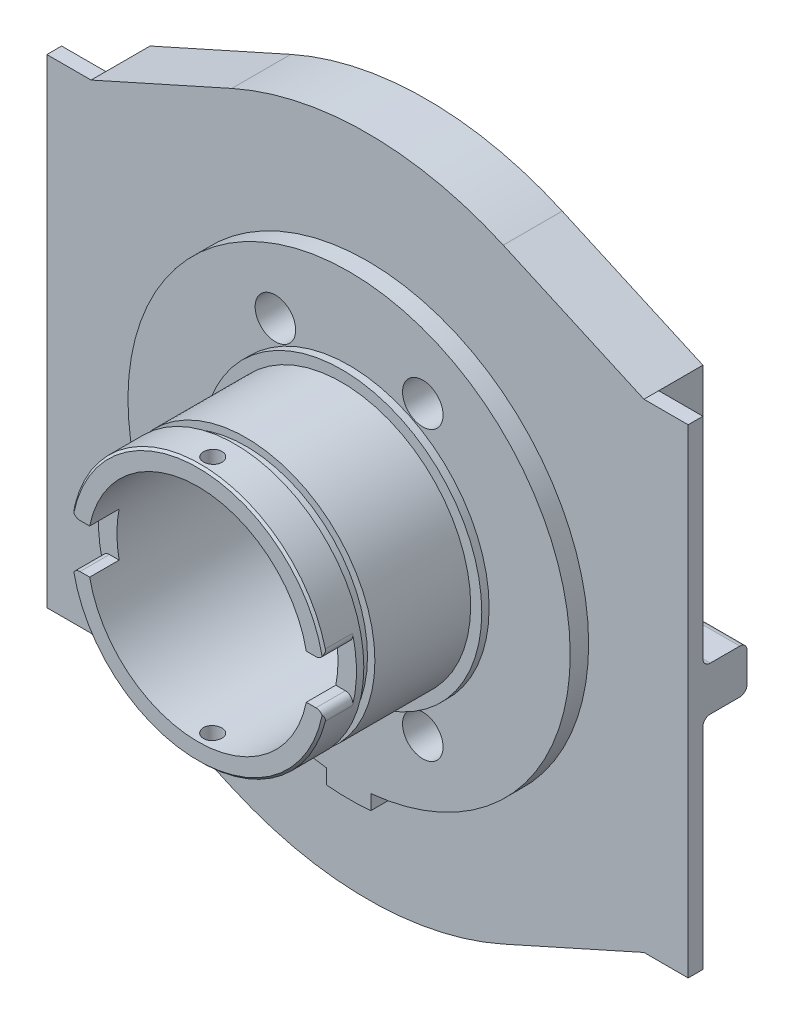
ISO-10303-21;
HEADER;
FILE_DESCRIPTION(('STEP AP214'),'2;1');
FILE_NAME('part.step','',(''),(''),'','','');
FILE_SCHEMA(('AUTOMOTIVE_DESIGN { 1 0 10303 214 1 1 1 1 }'));
ENDSEC;
DATA;
#1=APPLICATION_CONTEXT('core data for automotive mechanical design processes');
#2=APPLICATION_PROTOCOL_DEFINITION('international standard','automotive_design',2000,#1);
#3=PRODUCT_CONTEXT('',#1,'mechanical');
#4=PRODUCT('Part','Part','',(#3));
#5=PRODUCT_RELATED_PRODUCT_CATEGORY('part','',(#4));
#6=PRODUCT_DEFINITION_FORMATION('','',#4);
#7=PRODUCT_DEFINITION_CONTEXT('part definition',#1,'design');
#8=PRODUCT_DEFINITION('design','',#6,#7);
#9=PRODUCT_DEFINITION_SHAPE('','',#8);
#10=(LENGTH_UNIT() NAMED_UNIT(*) SI_UNIT(.MILLI.,.METRE.));
#11=(NAMED_UNIT(*) PLANE_ANGLE_UNIT() SI_UNIT($,.RADIAN.));
#12=(NAMED_UNIT(*) SI_UNIT($,.STERADIAN.) SOLID_ANGLE_UNIT());
#13=UNCERTAINTY_MEASURE_WITH_UNIT(LENGTH_MEASURE(1.E-05),#10,'distance_accuracy_value','');
#14=(GEOMETRIC_REPRESENTATION_CONTEXT(3) GLOBAL_UNCERTAINTY_ASSIGNED_CONTEXT((#13)) GLOBAL_UNIT_ASSIGNED_CONTEXT((#10,
#11,#12)) REPRESENTATION_CONTEXT('',''));
#15=CARTESIAN_POINT('',(0.,0.,0.));
#16=DIRECTION('',(0.,0.,1.));
#17=DIRECTION('',(1.,0.,0.));
#18=AXIS2_PLACEMENT_3D('',#15,#16,#17);
#19=CARTESIAN_POINT('',(0.,0.,4.));
#20=DIRECTION('',(0.,0.,1.));
#21=DIRECTION('',(1.,0.,0.));
#22=AXIS2_PLACEMENT_3D('',#19,#20,#21);
#23=PLANE('',#22);
#24=DIRECTION('',(0.,-1.,0.));
#25=VECTOR('',#24,1.);
#26=CARTESIAN_POINT('',(2.94915254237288,-31.863811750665,4.));
#27=LINE('',#26,#25);
#28=CARTESIAN_POINT('',(2.94915254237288,-29.8546897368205,4.));
#29=VERTEX_POINT('',#28);
#30=CARTESIAN_POINT('',(2.94915254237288,-31.863811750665,4.));
#31=VERTEX_POINT('',#30);
#32=EDGE_CURVE('E1259',#29,#31,#27,.T.);
#33=ORIENTED_EDGE('',*,*,#32,.T.);
#34=CARTESIAN_POINT('',(0.,0.,4.));
#35=DIRECTION('',(0.,0.,1.));
#36=DIRECTION('',(1.,0.,0.));
#37=AXIS2_PLACEMENT_3D('',#34,#35,#36);
#38=CIRCLE('',#37,32.);
#39=CARTESIAN_POINT('',(-3.0508474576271,-31.8542356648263,4.));
#40=VERTEX_POINT('',#39);
#41=EDGE_CURVE('E1266',#31,#40,#38,.F.);
#42=ORIENTED_EDGE('',*,*,#41,.T.);
#43=DIRECTION('',(0.,1.,0.));
#44=VECTOR('',#43,1.);
#45=CARTESIAN_POINT('',(-3.05084745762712,-31.8542356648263,4.));
#46=LINE('',#45,#44);
#47=CARTESIAN_POINT('',(-3.05084745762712,-29.8444689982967,4.));
#48=VERTEX_POINT('',#47);
#49=EDGE_CURVE('E1258',#40,#48,#46,.T.);
#50=ORIENTED_EDGE('',*,*,#49,.T.);
#51=CARTESIAN_POINT('',(0.,0.,4.));
#52=DIRECTION('',(0.,0.,1.));
#53=DIRECTION('',(1.,0.,0.));
#54=AXIS2_PLACEMENT_3D('',#51,#52,#53);
#55=CIRCLE('',#54,30.);
#56=EDGE_CURVE('E374',#29,#48,#55,.T.);
#57=ORIENTED_EDGE('',*,*,#56,.F.);
#58=EDGE_LOOP('',(#33,#42,#50,#57));
#59=FACE_BOUND('',#58,.T.);
#60=DIRECTION('',(1.,0.,0.));
#61=VECTOR('',#60,1.);
#62=CARTESIAN_POINT('',(43.5,-32.5,4.));
#63=LINE('',#62,#61);
#64=CARTESIAN_POINT('',(37.5,-32.5,4.));
#65=VERTEX_POINT('',#64);
#66=CARTESIAN_POINT('',(43.5,-32.5,4.));
#67=VERTEX_POINT('',#66);
#68=EDGE_CURVE('E818',#65,#67,#63,.T.);
#69=ORIENTED_EDGE('',*,*,#68,.T.);
#70=DIRECTION('',(0.,1.,0.));
#71=VECTOR('',#70,1.);
#72=CARTESIAN_POINT('',(43.5,32.5,4.));
#73=LINE('',#72,#71);
#74=CARTESIAN_POINT('',(43.5,32.5,4.));
#75=VERTEX_POINT('',#74);
#76=EDGE_CURVE('E821',#67,#75,#73,.T.);
#77=ORIENTED_EDGE('',*,*,#76,.T.);
#78=DIRECTION('',(-1.,0.,0.));
#79=VECTOR('',#78,1.);
#80=CARTESIAN_POINT('',(37.5,32.5,4.));
#81=LINE('',#80,#79);
#82=CARTESIAN_POINT('',(37.5,32.5,4.));
#83=VERTEX_POINT('',#82);
#84=EDGE_CURVE('E824',#75,#83,#81,.T.);
#85=ORIENTED_EDGE('',*,*,#84,.T.);
#86=DIRECTION('',(-0.91243402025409,0.409223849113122,0.));
#87=VECTOR('',#86,1.);
#88=CARTESIAN_POINT('',(18.4150732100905,41.059530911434,4.));
#89=LINE('',#88,#87);
#90=CARTESIAN_POINT('',(18.4150732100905,41.059530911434,4.));
#91=VERTEX_POINT('',#90);
#92=EDGE_CURVE('E826',#83,#91,#89,.T.);
#93=ORIENTED_EDGE('',*,*,#92,.T.);
#94=CARTESIAN_POINT('',(0.,0.,4.));
#95=DIRECTION('',(0.,0.,1.));
#96=DIRECTION('',(1.,0.,0.));
#97=AXIS2_PLACEMENT_3D('',#94,#95,#96);
#98=CIRCLE('',#97,45.);
#99=CARTESIAN_POINT('',(-18.4150732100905,41.059530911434,4.));
#100=VERTEX_POINT('',#99);
#101=EDGE_CURVE('E828',#91,#100,#98,.T.);
#102=ORIENTED_EDGE('',*,*,#101,.T.);
#103=DIRECTION('',(-0.91243402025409,-0.409223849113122,0.));
#104=VECTOR('',#103,1.);
#105=CARTESIAN_POINT('',(-18.4150732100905,41.059530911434,4.));
#106=LINE('',#105,#104);
#107=CARTESIAN_POINT('',(-37.5,32.5,4.));
#108=VERTEX_POINT('',#107);
#109=EDGE_CURVE('E830',#100,#108,#106,.T.);
#110=ORIENTED_EDGE('',*,*,#109,.T.);
#111=DIRECTION('',(-1.,0.,0.));
#112=VECTOR('',#111,1.);
#113=CARTESIAN_POINT('',(-37.5,32.5,4.));
#114=LINE('',#113,#112);
#115=CARTESIAN_POINT('',(-43.5,32.5,4.));
#116=VERTEX_POINT('',#115);
#117=EDGE_CURVE('E832',#108,#116,#114,.T.);
#118=ORIENTED_EDGE('',*,*,#117,.T.);
#119=DIRECTION('',(0.,-1.,0.));
#120=VECTOR('',#119,1.);
#121=CARTESIAN_POINT('',(-43.5,32.5,4.));
#122=LINE('',#121,#120);
#123=CARTESIAN_POINT('',(-43.5,-32.5,4.));
#124=VERTEX_POINT('',#123);
#125=EDGE_CURVE('E834',#116,#124,#122,.T.);
#126=ORIENTED_EDGE('',*,*,#125,.T.);
#127=DIRECTION('',(1.,0.,0.));
#128=VECTOR('',#127,1.);
#129=CARTESIAN_POINT('',(-43.5,-32.5,4.));
#130=LINE('',#129,#128);
#131=CARTESIAN_POINT('',(-37.5,-32.5,4.));
#132=VERTEX_POINT('',#131);
#133=EDGE_CURVE('E836',#124,#132,#130,.T.);
#134=ORIENTED_EDGE('',*,*,#133,.T.);
#135=DIRECTION('',(0.91243402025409,-0.409223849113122,0.));
#136=VECTOR('',#135,1.);
#137=CARTESIAN_POINT('',(-37.5,-32.5,4.));
#138=LINE('',#137,#136);
#139=CARTESIAN_POINT('',(-18.4150732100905,-41.0595309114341,4.));
#140=VERTEX_POINT('',#139);
#141=EDGE_CURVE('E838',#132,#140,#138,.T.);
#142=ORIENTED_EDGE('',*,*,#141,.T.);
#143=CARTESIAN_POINT('',(0.,0.,4.));
#144=DIRECTION('',(0.,0.,1.));
#145=DIRECTION('',(1.,0.,0.));
#146=AXIS2_PLACEMENT_3D('',#143,#144,#145);
#147=CIRCLE('',#146,45.);
#148=CARTESIAN_POINT('',(18.4150732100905,-41.059530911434,4.));
#149=VERTEX_POINT('',#148);
#150=EDGE_CURVE('E840',#140,#149,#147,.T.);
#151=ORIENTED_EDGE('',*,*,#150,.T.);
#152=DIRECTION('',(0.912434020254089,0.409223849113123,0.));
#153=VECTOR('',#152,1.);
#154=CARTESIAN_POINT('',(37.5,-32.5,4.));
#155=LINE('',#154,#153);
#156=EDGE_CURVE('E842',#149,#65,#155,.T.);
#157=ORIENTED_EDGE('',*,*,#156,.T.);
#158=EDGE_LOOP('',(#69,#77,#85,#93,#102,#110,#118,#126,#134,#142,#151,#157));
#159=FACE_BOUND('',#158,.T.);
#160=ADVANCED_FACE('F38',(#59,#159),#23,.T.);
#161=CARTESIAN_POINT('',(10.,-19.5,4.));
#162=DIRECTION('',(0.,0.,1.));
#163=DIRECTION('',(1.,0.,0.));
#164=AXIS2_PLACEMENT_3D('',#161,#162,#163);
#165=CYLINDRICAL_SURFACE('',#164,1.24999999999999);
#166=CARTESIAN_POINT('',(10.,-19.5,-4.));
#167=DIRECTION('',(0.,0.,1.));
#168=DIRECTION('',(1.,0.,0.));
#169=AXIS2_PLACEMENT_3D('',#166,#167,#168);
#170=CIRCLE('',#169,1.25);
#171=CARTESIAN_POINT('',(11.25,-19.5,-4.));
#172=VERTEX_POINT('',#171);
#173=EDGE_CURVE('E811',#172,#172,#170,.T.);
#174=ORIENTED_EDGE('',*,*,#173,.F.);
#175=EDGE_LOOP('',(#174));
#176=FACE_BOUND('',#175,.T.);
#177=CARTESIAN_POINT('',(10.,-19.5,2.5));
#178=DIRECTION('',(0.,0.,1.));
#179=DIRECTION('',(1.,0.,0.));
#180=AXIS2_PLACEMENT_3D('',#177,#178,#179);
#181=CIRCLE('',#180,1.24999999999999);
#182=CARTESIAN_POINT('',(11.25,-19.5,2.5));
#183=VERTEX_POINT('',#182);
#184=EDGE_CURVE('E43',#183,#183,#181,.F.);
#185=ORIENTED_EDGE('',*,*,#184,.F.);
#186=EDGE_LOOP('',(#185));
#187=FACE_BOUND('',#186,.T.);
#188=ADVANCED_FACE('F448',(#176,#187),#165,.F.);
#189=CARTESIAN_POINT('',(-10.,-19.5,4.));
#190=DIRECTION('',(0.,0.,1.));
#191=DIRECTION('',(1.,0.,0.));
#192=AXIS2_PLACEMENT_3D('',#189,#190,#191);
#193=CYLINDRICAL_SURFACE('',#192,1.24999999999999);
#194=CARTESIAN_POINT('',(-10.,-19.5,-4.));
#195=DIRECTION('',(0.,0.,1.));
#196=DIRECTION('',(1.,0.,0.));
#197=AXIS2_PLACEMENT_3D('',#194,#195,#196);
#198=CIRCLE('',#197,1.25);
#199=CARTESIAN_POINT('',(-8.75,-19.5,-4.));
#200=VERTEX_POINT('',#199);
#201=EDGE_CURVE('E808',#200,#200,#198,.T.);
#202=ORIENTED_EDGE('',*,*,#201,.F.);
#203=EDGE_LOOP('',(#202));
#204=FACE_BOUND('',#203,.T.);
#205=CARTESIAN_POINT('',(-10.,-19.5,2.5));
#206=DIRECTION('',(0.,0.,1.));
#207=DIRECTION('',(1.,0.,0.));
#208=AXIS2_PLACEMENT_3D('',#205,#206,#207);
#209=CIRCLE('',#208,1.24999999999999);
#210=CARTESIAN_POINT('',(-8.75,-19.5,2.5));
#211=VERTEX_POINT('',#210);
#212=EDGE_CURVE('E1202',#211,#211,#209,.F.);
#213=ORIENTED_EDGE('',*,*,#212,.F.);
#214=EDGE_LOOP('',(#213));
#215=FACE_BOUND('',#214,.T.);
#216=ADVANCED_FACE('F1189',(#204,#215),#193,.F.);
#217=CARTESIAN_POINT('',(-10.,19.5,4.));
#218=DIRECTION('',(0.,0.,1.));
#219=DIRECTION('',(1.,0.,0.));
#220=AXIS2_PLACEMENT_3D('',#217,#218,#219);
#221=CYLINDRICAL_SURFACE('',#220,1.24999999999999);
#222=CARTESIAN_POINT('',(-10.,19.5,-4.));
#223=DIRECTION('',(0.,0.,1.));
#224=DIRECTION('',(1.,0.,0.));
#225=AXIS2_PLACEMENT_3D('',#222,#223,#224);
#226=CIRCLE('',#225,1.25);
#227=CARTESIAN_POINT('',(-8.75,19.5,-4.));
#228=VERTEX_POINT('',#227);
#229=EDGE_CURVE('E802',#228,#228,#226,.T.);
#230=ORIENTED_EDGE('',*,*,#229,.F.);
#231=EDGE_LOOP('',(#230));
#232=FACE_BOUND('',#231,.T.);
#233=CARTESIAN_POINT('',(-10.,19.5,2.5));
#234=DIRECTION('',(0.,0.,1.));
#235=DIRECTION('',(1.,0.,0.));
#236=AXIS2_PLACEMENT_3D('',#233,#234,#235);
#237=CIRCLE('',#236,1.24999999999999);
#238=CARTESIAN_POINT('',(-8.75,19.5,2.5));
#239=VERTEX_POINT('',#238);
#240=EDGE_CURVE('E391',#239,#239,#237,.F.);
#241=ORIENTED_EDGE('',*,*,#240,.F.);
#242=EDGE_LOOP('',(#241));
#243=FACE_BOUND('',#242,.T.);
#244=ADVANCED_FACE('F1183',(#232,#243),#221,.F.);
#245=CARTESIAN_POINT('',(10.,19.5,4.));
#246=DIRECTION('',(0.,0.,1.));
#247=DIRECTION('',(1.,0.,0.));
#248=AXIS2_PLACEMENT_3D('',#245,#246,#247);
#249=CYLINDRICAL_SURFACE('',#248,1.24999999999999);
#250=CARTESIAN_POINT('',(10.,19.5,-4.));
#251=DIRECTION('',(0.,0.,1.));
#252=DIRECTION('',(1.,0.,0.));
#253=AXIS2_PLACEMENT_3D('',#250,#251,#252);
#254=CIRCLE('',#253,1.25);
#255=CARTESIAN_POINT('',(11.25,19.5,-4.));
#256=VERTEX_POINT('',#255);
#257=EDGE_CURVE('E805',#256,#256,#254,.T.);
#258=ORIENTED_EDGE('',*,*,#257,.F.);
#259=EDGE_LOOP('',(#258));
#260=FACE_BOUND('',#259,.T.);
#261=CARTESIAN_POINT('',(10.,19.5,2.5));
#262=DIRECTION('',(0.,0.,1.));
#263=DIRECTION('',(1.,0.,0.));
#264=AXIS2_PLACEMENT_3D('',#261,#262,#263);
#265=CIRCLE('',#264,1.24999999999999);
#266=CARTESIAN_POINT('',(11.25,19.5,2.5));
#267=VERTEX_POINT('',#266);
#268=EDGE_CURVE('E397',#267,#267,#265,.F.);
#269=ORIENTED_EDGE('',*,*,#268,.F.);
#270=EDGE_LOOP('',(#269));
#271=FACE_BOUND('',#270,.T.);
#272=ADVANCED_FACE('F1167',(#260,#271),#249,.F.);
#273=CARTESIAN_POINT('',(0.,0.,27.));
#274=DIRECTION('',(0.,0.,-1.));
#275=DIRECTION('',(-1.,0.,0.));
#276=AXIS2_PLACEMENT_3D('',#273,#274,#275);
#277=CYLINDRICAL_SURFACE('',#276,17.5);
#278=CARTESIAN_POINT('',(0.,-17.5,26.25));
#279=CARTESIAN_POINT('',(0.0701171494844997,-17.4999994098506,26.2499969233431));
#280=CARTESIAN_POINT('',(0.140282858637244,-17.4995740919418,26.2440804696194));
#281=CARTESIAN_POINT('',(0.278675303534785,-17.4979183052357,26.2205643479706));
#282=CARTESIAN_POINT('',(0.346899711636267,-17.4966869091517,26.2029512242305));
#283=CARTESIAN_POINT('',(0.479385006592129,-17.4935582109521,26.1565515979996));
#284=CARTESIAN_POINT('',(0.543648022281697,-17.4916612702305,26.1277711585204));
#285=CARTESIAN_POINT('',(0.666414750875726,-17.4874145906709,26.0598641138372));
#286=CARTESIAN_POINT('',(0.724919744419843,-17.4850649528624,26.0207398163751));
#287=CARTESIAN_POINT('',(0.83463778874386,-17.4801717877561,25.9331742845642));
#288=CARTESIAN_POINT('',(0.885838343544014,-17.4776279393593,25.8847174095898));
#289=CARTESIAN_POINT('',(0.979387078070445,-17.4726357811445,25.7798948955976));
#290=CARTESIAN_POINT('',(1.02173488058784,-17.4701874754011,25.72352891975));
#291=CARTESIAN_POINT('',(1.09641641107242,-17.4656599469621,25.604415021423));
#292=CARTESIAN_POINT('',(1.12873946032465,-17.4635811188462,25.5416603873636));
#293=CARTESIAN_POINT('',(1.18238568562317,-17.4600312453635,25.4115974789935));
#294=CARTESIAN_POINT('',(1.20370900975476,-17.4585601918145,25.3442892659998));
#295=CARTESIAN_POINT('',(1.2347150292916,-17.4563948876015,25.2071526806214));
#296=CARTESIAN_POINT('',(1.24441769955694,-17.455699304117,25.1373288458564));
#297=CARTESIAN_POINT('',(1.25196866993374,-17.4551593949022,24.9970403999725));
#298=CARTESIAN_POINT('',(1.24981713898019,-17.4553150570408,24.9265757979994));
#299=CARTESIAN_POINT('',(1.23373732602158,-17.4564588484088,24.7871424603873));
#300=CARTESIAN_POINT('',(1.21983069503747,-17.4574454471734,24.7181712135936));
#301=CARTESIAN_POINT('',(1.18066904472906,-17.4601375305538,24.5835444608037));
#302=CARTESIAN_POINT('',(1.15541394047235,-17.46184302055,24.5178889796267));
#303=CARTESIAN_POINT('',(1.09424779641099,-17.4657824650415,24.3916881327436));
#304=CARTESIAN_POINT('',(1.05832697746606,-17.4680169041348,24.3311475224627));
#305=CARTESIAN_POINT('',(0.976856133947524,-17.4727619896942,24.2169469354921));
#306=CARTESIAN_POINT('',(0.931305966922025,-17.475272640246,24.1632870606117));
#307=CARTESIAN_POINT('',(0.831747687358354,-17.4802940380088,24.0642452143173));
#308=CARTESIAN_POINT('',(0.777720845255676,-17.4828047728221,24.0188820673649));
#309=CARTESIAN_POINT('',(0.662808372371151,-17.4875380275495,23.9378667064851));
#310=CARTESIAN_POINT('',(0.601922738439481,-17.4897605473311,23.9022144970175));
#311=CARTESIAN_POINT('',(0.475009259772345,-17.4936672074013,23.8416344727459));
#312=CARTESIAN_POINT('',(0.408981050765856,-17.4953513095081,23.8167074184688));
#313=CARTESIAN_POINT('',(0.273662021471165,-17.4979908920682,23.7782981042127));
#314=CARTESIAN_POINT('',(0.204371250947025,-17.4989463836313,23.7648156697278));
#315=CARTESIAN_POINT('',(0.0646572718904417,-17.5000196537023,23.7497017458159));
#316=CARTESIAN_POINT('',(-0.00576310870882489,-17.5001392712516,23.7480442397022));
#317=CARTESIAN_POINT('',(-0.145880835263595,-17.4995322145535,23.756559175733));
#318=CARTESIAN_POINT('',(-0.215578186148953,-17.4988055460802,23.766731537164));
#319=CARTESIAN_POINT('',(-0.352197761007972,-17.4965888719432,23.7985959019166));
#320=CARTESIAN_POINT('',(-0.41912279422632,-17.4950996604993,23.8202759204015));
#321=CARTESIAN_POINT('',(-0.54838480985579,-17.4915253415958,23.8745279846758));
#322=CARTESIAN_POINT('',(-0.610721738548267,-17.4894402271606,23.9071001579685));
#323=CARTESIAN_POINT('',(-0.72915687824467,-17.4849035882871,23.9822778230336));
#324=CARTESIAN_POINT('',(-0.78524407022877,-17.4824514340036,24.0249006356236));
#325=CARTESIAN_POINT('',(-0.889476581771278,-17.4774586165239,24.1189445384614));
#326=CARTESIAN_POINT('',(-0.937621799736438,-17.474917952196,24.1703657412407));
#327=CARTESIAN_POINT('',(-1.02469226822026,-17.4700290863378,24.2806592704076));
#328=CARTESIAN_POINT('',(-1.06360060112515,-17.4676812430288,24.3395449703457));
#329=CARTESIAN_POINT('',(-1.13097700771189,-17.4634485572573,24.4630289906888));
#330=CARTESIAN_POINT('',(-1.15944516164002,-17.4615637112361,24.5276272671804));
#331=CARTESIAN_POINT('',(-1.20510399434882,-17.4584721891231,24.6606416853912));
#332=CARTESIAN_POINT('',(-1.22230520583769,-17.4572648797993,24.729054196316));
#333=CARTESIAN_POINT('',(-1.24497623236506,-17.4556628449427,24.8678052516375));
#334=CARTESIAN_POINT('',(-1.25044620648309,-17.4552681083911,24.9381437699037));
#335=CARTESIAN_POINT('',(-1.24949784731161,-17.4553360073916,25.0785820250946));
#336=CARTESIAN_POINT('',(-1.24310610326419,-17.4557967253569,25.1486819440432));
#337=CARTESIAN_POINT('',(-1.21867099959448,-17.457519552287,25.2868103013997));
#338=CARTESIAN_POINT('',(-1.20062762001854,-17.4587816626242,25.3548387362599));
#339=CARTESIAN_POINT('',(-1.15340774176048,-17.4619645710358,25.4868960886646));
#340=CARTESIAN_POINT('',(-1.12423151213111,-17.4638853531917,25.5509251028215));
#341=CARTESIAN_POINT('',(-1.0555774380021,-17.4681691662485,25.6731798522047));
#342=CARTESIAN_POINT('',(-1.01609981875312,-17.4705321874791,25.7314057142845));
#343=CARTESIAN_POINT('',(-0.927864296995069,-17.4754404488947,25.8405368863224));
#344=CARTESIAN_POINT('',(-0.87908691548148,-17.4779860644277,25.8914264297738));
#345=CARTESIAN_POINT('',(-0.773667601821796,-17.482969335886,25.9843140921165));
#346=CARTESIAN_POINT('',(-0.717023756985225,-17.4854069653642,26.0263100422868));
#347=CARTESIAN_POINT('',(-0.597397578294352,-17.4899028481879,26.1002591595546));
#348=CARTESIAN_POINT('',(-0.534405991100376,-17.4919605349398,26.1321973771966));
#349=CARTESIAN_POINT('',(-0.403984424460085,-17.4954575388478,26.1850042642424));
#350=CARTESIAN_POINT('',(-0.336559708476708,-17.4968975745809,26.2058858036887));
#351=CARTESIAN_POINT('',(-0.223940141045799,-17.4986226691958,26.2306021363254));
#352=CARTESIAN_POINT('',(-0.179471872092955,-17.4991368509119,26.237866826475));
#353=CARTESIAN_POINT('',(-0.0900090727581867,-17.4998257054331,26.2475667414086));
#354=CARTESIAN_POINT('',(-0.0450145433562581,-17.5000003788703,26.2500019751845));
#355=CARTESIAN_POINT('',(0.,-17.5,26.25));
#356=B_SPLINE_CURVE_WITH_KNOTS('',3,(#278,#279,#280,#281,#282,#283,#284,#285,#286,#287,#288,
#289,#290,#291,#292,#293,#294,#295,#296,#297,#298,#299,#300,#301,#302,#303,#304,#305,#306,#307,
#308,#309,#310,#311,#312,#313,#314,#315,#316,#317,#318,#319,#320,#321,#322,#323,#324,#325,#326,
#327,#328,#329,#330,#331,#332,#333,#334,#335,#336,#337,#338,#339,#340,#341,#342,#343,#344,#345,
#346,#347,#348,#349,#350,#351,#352,#353,#354,#355),.UNSPECIFIED.,.T.,.F.,(4,2,2,2,2,2,2,2,2,2,2,
2,2,2,2,2,2,2,2,2,2,2,2,2,2,2,2,2,2,2,2,2,2,2,2,2,2,2,4),(0.,0.210187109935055,
0.420616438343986,0.630931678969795,0.84120003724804,1.0518239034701,1.26245674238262,
1.47331319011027,1.68416679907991,1.89465744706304,2.10514509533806,2.31524590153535,
2.52534828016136,2.73564389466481,2.94594262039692,3.15671272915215,3.36748293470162,
3.57826808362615,3.78905001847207,3.99936805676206,4.2096846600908,4.41978265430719,
4.62988310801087,4.84034832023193,5.05081622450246,5.26166668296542,5.47251552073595,
5.68316696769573,5.89381555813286,6.10399252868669,6.3141698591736,6.52434211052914,
6.73450976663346,6.94512256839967,7.1557866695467,7.36676243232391,7.57749207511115,
7.71243045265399,7.84736857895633),.UNSPECIFIED.);
#357=CARTESIAN_POINT('',(0.,-17.5,26.25));
#358=VERTEX_POINT('',#357);
#359=EDGE_CURVE('E405',#358,#358,#356,.T.);
#360=ORIENTED_EDGE('',*,*,#359,.T.);
#361=EDGE_LOOP('',(#360));
#362=FACE_BOUND('',#361,.T.);
#363=CARTESIAN_POINT('',(0.,17.5,26.25));
#364=CARTESIAN_POINT('',(-0.0701171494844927,17.4999994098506,26.2499969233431));
#365=CARTESIAN_POINT('',(-0.140282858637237,17.4995740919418,26.2440804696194));
#366=CARTESIAN_POINT('',(-0.278675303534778,17.4979183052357,26.2205643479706));
#367=CARTESIAN_POINT('',(-0.34689971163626,17.4966869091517,26.2029512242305));
#368=CARTESIAN_POINT('',(-0.479385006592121,17.4935582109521,26.1565515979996));
#369=CARTESIAN_POINT('',(-0.543648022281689,17.4916612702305,26.1277711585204));
#370=CARTESIAN_POINT('',(-0.666414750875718,17.4874145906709,26.0598641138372));
#371=CARTESIAN_POINT('',(-0.724919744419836,17.4850649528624,26.0207398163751));
#372=CARTESIAN_POINT('',(-0.834637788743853,17.4801717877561,25.9331742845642));
#373=CARTESIAN_POINT('',(-0.885838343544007,17.4776279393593,25.8847174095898));
#374=CARTESIAN_POINT('',(-0.979387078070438,17.4726357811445,25.7798948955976));
#375=CARTESIAN_POINT('',(-1.02173488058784,17.4701874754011,25.72352891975));
#376=CARTESIAN_POINT('',(-1.09641641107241,17.4656599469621,25.604415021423));
#377=CARTESIAN_POINT('',(-1.12873946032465,17.4635811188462,25.5416603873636));
#378=CARTESIAN_POINT('',(-1.18238568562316,17.4600312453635,25.4115974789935));
#379=CARTESIAN_POINT('',(-1.20370900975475,17.4585601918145,25.3442892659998));
#380=CARTESIAN_POINT('',(-1.23471502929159,17.4563948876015,25.2071526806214));
#381=CARTESIAN_POINT('',(-1.24441769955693,17.455699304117,25.1373288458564));
#382=CARTESIAN_POINT('',(-1.25196866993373,17.4551593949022,24.9970403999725));
#383=CARTESIAN_POINT('',(-1.24981713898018,17.4553150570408,24.9265757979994));
#384=CARTESIAN_POINT('',(-1.23373732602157,17.4564588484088,24.7871424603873));
#385=CARTESIAN_POINT('',(-1.21983069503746,17.4574454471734,24.7181712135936));
#386=CARTESIAN_POINT('',(-1.18066904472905,17.4601375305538,24.5835444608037));
#387=CARTESIAN_POINT('',(-1.15541394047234,17.46184302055,24.5178889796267));
#388=CARTESIAN_POINT('',(-1.09424779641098,17.4657824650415,24.3916881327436));
#389=CARTESIAN_POINT('',(-1.05832697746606,17.4680169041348,24.3311475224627));
#390=CARTESIAN_POINT('',(-0.976856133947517,17.4727619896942,24.2169469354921));
#391=CARTESIAN_POINT('',(-0.931305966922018,17.475272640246,24.1632870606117));
#392=CARTESIAN_POINT('',(-0.831747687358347,17.4802940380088,24.0642452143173));
#393=CARTESIAN_POINT('',(-0.777720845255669,17.4828047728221,24.0188820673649));
#394=CARTESIAN_POINT('',(-0.662808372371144,17.4875380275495,23.9378667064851));
#395=CARTESIAN_POINT('',(-0.601922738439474,17.4897605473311,23.9022144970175));
#396=CARTESIAN_POINT('',(-0.475009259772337,17.4936672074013,23.8416344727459));
#397=CARTESIAN_POINT('',(-0.408981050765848,17.4953513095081,23.8167074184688));
#398=CARTESIAN_POINT('',(-0.273662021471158,17.4979908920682,23.7782981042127));
#399=CARTESIAN_POINT('',(-0.204371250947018,17.4989463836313,23.7648156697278));
#400=CARTESIAN_POINT('',(-0.0646572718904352,17.5000196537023,23.7497017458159));
#401=CARTESIAN_POINT('',(0.00576310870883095,17.5001392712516,23.7480442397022));
#402=CARTESIAN_POINT('',(0.145880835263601,17.4995322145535,23.756559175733));
#403=CARTESIAN_POINT('',(0.215578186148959,17.4988055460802,23.766731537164));
#404=CARTESIAN_POINT('',(0.352197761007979,17.4965888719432,23.7985959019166));
#405=CARTESIAN_POINT('',(0.419122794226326,17.4950996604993,23.8202759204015));
#406=CARTESIAN_POINT('',(0.548384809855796,17.4915253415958,23.8745279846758));
#407=CARTESIAN_POINT('',(0.610721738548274,17.4894402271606,23.9071001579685));
#408=CARTESIAN_POINT('',(0.729156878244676,17.4849035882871,23.9822778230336));
#409=CARTESIAN_POINT('',(0.785244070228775,17.4824514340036,24.0249006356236));
#410=CARTESIAN_POINT('',(0.889476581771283,17.4774586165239,24.1189445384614));
#411=CARTESIAN_POINT('',(0.937621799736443,17.474917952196,24.1703657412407));
#412=CARTESIAN_POINT('',(1.02469226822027,17.4700290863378,24.2806592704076));
#413=CARTESIAN_POINT('',(1.06360060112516,17.4676812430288,24.3395449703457));
#414=CARTESIAN_POINT('',(1.1309770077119,17.4634485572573,24.4630289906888));
#415=CARTESIAN_POINT('',(1.15944516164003,17.4615637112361,24.5276272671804));
#416=CARTESIAN_POINT('',(1.20510399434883,17.4584721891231,24.6606416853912));
#417=CARTESIAN_POINT('',(1.2223052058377,17.4572648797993,24.729054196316));
#418=CARTESIAN_POINT('',(1.24497623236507,17.4556628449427,24.8678052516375));
#419=CARTESIAN_POINT('',(1.2504462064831,17.4552681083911,24.9381437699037));
#420=CARTESIAN_POINT('',(1.24949784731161,17.4553360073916,25.0785820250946));
#421=CARTESIAN_POINT('',(1.2431061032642,17.4557967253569,25.1486819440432));
#422=CARTESIAN_POINT('',(1.21867099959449,17.457519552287,25.2868103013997));
#423=CARTESIAN_POINT('',(1.20062762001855,17.4587816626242,25.3548387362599));
#424=CARTESIAN_POINT('',(1.15340774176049,17.4619645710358,25.4868960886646));
#425=CARTESIAN_POINT('',(1.12423151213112,17.4638853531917,25.5509251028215));
#426=CARTESIAN_POINT('',(1.05557743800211,17.4681691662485,25.6731798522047));
#427=CARTESIAN_POINT('',(1.01609981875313,17.4705321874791,25.7314057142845));
#428=CARTESIAN_POINT('',(0.927864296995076,17.4754404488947,25.8405368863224));
#429=CARTESIAN_POINT('',(0.879086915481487,17.4779860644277,25.8914264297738));
#430=CARTESIAN_POINT('',(0.773667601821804,17.4829693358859,25.9843140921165));
#431=CARTESIAN_POINT('',(0.717023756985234,17.4854069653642,26.0263100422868));
#432=CARTESIAN_POINT('',(0.597397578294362,17.4899028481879,26.1002591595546));
#433=CARTESIAN_POINT('',(0.534405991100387,17.4919605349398,26.1321973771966));
#434=CARTESIAN_POINT('',(0.403984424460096,17.4954575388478,26.1850042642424));
#435=CARTESIAN_POINT('',(0.336559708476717,17.4968975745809,26.2058858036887));
#436=CARTESIAN_POINT('',(0.223940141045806,17.4986226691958,26.2306021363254));
#437=CARTESIAN_POINT('',(0.179471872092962,17.4991368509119,26.237866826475));
#438=CARTESIAN_POINT('',(0.0900090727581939,17.4998257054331,26.2475667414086));
#439=CARTESIAN_POINT('',(0.0450145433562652,17.5000003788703,26.2500019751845));
#440=CARTESIAN_POINT('',(0.,17.5,26.25));
#441=B_SPLINE_CURVE_WITH_KNOTS('',3,(#363,#364,#365,#366,#367,#368,#369,#370,#371,#372,#373,
#374,#375,#376,#377,#378,#379,#380,#381,#382,#383,#384,#385,#386,#387,#388,#389,#390,#391,#392,
#393,#394,#395,#396,#397,#398,#399,#400,#401,#402,#403,#404,#405,#406,#407,#408,#409,#410,#411,
#412,#413,#414,#415,#416,#417,#418,#419,#420,#421,#422,#423,#424,#425,#426,#427,#428,#429,#430,
#431,#432,#433,#434,#435,#436,#437,#438,#439,#440),.UNSPECIFIED.,.T.,.F.,(4,2,2,2,2,2,2,2,2,2,2,
2,2,2,2,2,2,2,2,2,2,2,2,2,2,2,2,2,2,2,2,2,2,2,2,2,2,2,4),(0.,0.210187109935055,
0.420616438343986,0.630931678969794,0.84120003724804,1.0518239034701,1.26245674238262,
1.47331319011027,1.68416679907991,1.89465744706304,2.10514509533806,2.31524590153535,
2.52534828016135,2.73564389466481,2.94594262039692,3.15671272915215,3.36748293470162,
3.57826808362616,3.78905001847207,3.99936805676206,4.2096846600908,4.41978265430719,
4.62988310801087,4.84034832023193,5.05081622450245,5.26166668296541,5.47251552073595,
5.68316696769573,5.89381555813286,6.10399252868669,6.3141698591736,6.52434211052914,
6.73450976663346,6.94512256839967,7.1557866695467,7.36676243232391,7.57749207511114,
7.71243045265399,7.84736857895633),.UNSPECIFIED.);
#442=CARTESIAN_POINT('',(0.,17.5,26.25));
#443=VERTEX_POINT('',#442);
#444=EDGE_CURVE('E398',#443,#443,#441,.T.);
#445=ORIENTED_EDGE('',*,*,#444,.T.);
#446=EDGE_LOOP('',(#445));
#447=FACE_BOUND('',#446,.T.);
#448=CARTESIAN_POINT('',(0.,0.,23.));
#449=DIRECTION('',(0.,0.,-1.));
#450=DIRECTION('',(-1.,0.,0.));
#451=AXIS2_PLACEMENT_3D('',#448,#449,#450);
#452=CIRCLE('',#451,17.5);
#453=CARTESIAN_POINT('',(16.9779809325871,4.2424242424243,23.));
#454=VERTEX_POINT('',#453);
#455=CARTESIAN_POINT('',(16.9779809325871,-4.24242424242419,23.));
#456=VERTEX_POINT('',#455);
#457=EDGE_CURVE('E627',#454,#456,#452,.T.);
#458=ORIENTED_EDGE('',*,*,#457,.T.);
#459=DIRECTION('',(0.,0.,-1.));
#460=VECTOR('',#459,1.);
#461=CARTESIAN_POINT('',(16.9779809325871,-4.24242424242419,27.));
#462=LINE('',#461,#460);
#463=CARTESIAN_POINT('',(16.9779809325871,-4.24242424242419,26.7));
#464=VERTEX_POINT('',#463);
#465=EDGE_CURVE('E636',#456,#464,#462,.F.);
#466=ORIENTED_EDGE('',*,*,#465,.T.);
#467=CARTESIAN_POINT('',(0.,0.,26.7));
#468=DIRECTION('',(0.,0.,1.));
#469=DIRECTION('',(1.,0.,0.));
#470=AXIS2_PLACEMENT_3D('',#467,#468,#469);
#471=CIRCLE('',#470,17.5);
#472=CARTESIAN_POINT('',(-16.9779809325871,-4.2424242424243,26.7));
#473=VERTEX_POINT('',#472);
#474=EDGE_CURVE('E618',#464,#473,#471,.F.);
#475=ORIENTED_EDGE('',*,*,#474,.T.);
#476=DIRECTION('',(0.,0.,-1.));
#477=VECTOR('',#476,1.);
#478=CARTESIAN_POINT('',(-16.9779809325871,-4.2424242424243,27.));
#479=LINE('',#478,#477);
#480=CARTESIAN_POINT('',(-16.9779809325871,-4.2424242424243,23.));
#481=VERTEX_POINT('',#480);
#482=EDGE_CURVE('E628',#473,#481,#479,.T.);
#483=ORIENTED_EDGE('',*,*,#482,.T.);
#484=CARTESIAN_POINT('',(-16.9779809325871,4.24242424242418,23.));
#485=VERTEX_POINT('',#484);
#486=EDGE_CURVE('E625',#481,#485,#452,.T.);
#487=ORIENTED_EDGE('',*,*,#486,.T.);
#488=DIRECTION('',(0.,0.,-1.));
#489=VECTOR('',#488,1.);
#490=CARTESIAN_POINT('',(-16.9779809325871,4.24242424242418,27.));
#491=LINE('',#490,#489);
#492=CARTESIAN_POINT('',(-16.9779809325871,4.24242424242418,26.7));
#493=VERTEX_POINT('',#492);
#494=EDGE_CURVE('E631',#485,#493,#491,.F.);
#495=ORIENTED_EDGE('',*,*,#494,.T.);
#496=CARTESIAN_POINT('',(16.9779809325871,4.2424242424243,26.7));
#497=VERTEX_POINT('',#496);
#498=EDGE_CURVE('E615',#493,#497,#471,.F.);
#499=ORIENTED_EDGE('',*,*,#498,.T.);
#500=DIRECTION('',(0.,0.,-1.));
#501=VECTOR('',#500,1.);
#502=CARTESIAN_POINT('',(16.9779809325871,4.2424242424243,27.));
#503=LINE('',#502,#501);
#504=EDGE_CURVE('E634',#497,#454,#503,.T.);
#505=ORIENTED_EDGE('',*,*,#504,.T.);
#506=EDGE_LOOP('',(#458,#466,#475,#483,#487,#495,#499,#505));
#507=FACE_BOUND('',#506,.T.);
#508=CARTESIAN_POINT('',(0.,0.,22.));
#509=DIRECTION('',(0.,0.,1.));
#510=DIRECTION('',(1.,0.,0.));
#511=AXIS2_PLACEMENT_3D('',#508,#509,#510);
#512=CIRCLE('',#511,17.5);
#513=CARTESIAN_POINT('',(17.5,0.,22.));
#514=VERTEX_POINT('',#513);
#515=EDGE_CURVE('E691',#514,#514,#512,.T.);
#516=ORIENTED_EDGE('',*,*,#515,.T.);
#517=EDGE_LOOP('',(#516));
#518=FACE_BOUND('',#517,.T.);
#519=ADVANCED_FACE('F410',(#362,#447,#507,#518),#277,.T.);
#520=CARTESIAN_POINT('',(0.,0.,7.5));
#521=DIRECTION('',(0.,0.,1.));
#522=DIRECTION('',(1.,0.,0.));
#523=AXIS2_PLACEMENT_3D('',#520,#521,#522);
#524=CIRCLE('',#523,17.5);
#525=CARTESIAN_POINT('',(17.5,0.,7.5));
#526=VERTEX_POINT('',#525);
#527=EDGE_CURVE('E792',#526,#526,#524,.T.);
#528=ORIENTED_EDGE('',*,*,#527,.T.);
#529=EDGE_LOOP('',(#528));
#530=FACE_BOUND('',#529,.T.);
#531=CARTESIAN_POINT('',(0.,0.,20.5));
#532=DIRECTION('',(0.,0.,1.));
#533=DIRECTION('',(1.,0.,0.));
#534=AXIS2_PLACEMENT_3D('',#531,#532,#533);
#535=CIRCLE('',#534,17.5);
#536=CARTESIAN_POINT('',(17.5,0.,20.5));
#537=VERTEX_POINT('',#536);
#538=EDGE_CURVE('E1157',#537,#537,#535,.T.);
#539=ORIENTED_EDGE('',*,*,#538,.F.);
#540=EDGE_LOOP('',(#539));
#541=FACE_BOUND('',#540,.T.);
#542=ADVANCED_FACE('F1096',(#530,#541),#277,.T.);
#543=CARTESIAN_POINT('',(0.,0.,27.));
#544=DIRECTION('',(0.,0.,1.));
#545=DIRECTION('',(1.,0.,0.));
#546=AXIS2_PLACEMENT_3D('',#543,#544,#545);
#547=PLANE('',#546);
#548=CARTESIAN_POINT('',(0.,0.,27.));
#549=DIRECTION('',(0.,0.,1.));
#550=DIRECTION('',(1.,0.,0.));
#551=AXIS2_PLACEMENT_3D('',#548,#549,#550);
#552=CIRCLE('',#551,17.2);
#553=CARTESIAN_POINT('',(-16.8486563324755,-3.45872516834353,27.));
#554=VERTEX_POINT('',#553);
#555=CARTESIAN_POINT('',(16.8486563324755,-3.45872516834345,27.));
#556=VERTEX_POINT('',#555);
#557=EDGE_CURVE('E616',#554,#556,#552,.T.);
#558=ORIENTED_EDGE('',*,*,#557,.T.);
#559=CARTESIAN_POINT('',(16.0078105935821,-3.99999999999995,27.));
#560=DIRECTION('',(0.,0.,1.));
#561=DIRECTION('',(1.,0.,0.));
#562=AXIS2_PLACEMENT_3D('',#559,#560,#561);
#563=CIRCLE('',#562,1.);
#564=CARTESIAN_POINT('',(16.0078105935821,-2.99999999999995,27.));
#565=VERTEX_POINT('',#564);
#566=EDGE_CURVE('E575',#556,#565,#563,.T.);
#567=ORIENTED_EDGE('',*,*,#566,.T.);
#568=DIRECTION('',(1.,0.,0.));
#569=VECTOR('',#568,1.);
#570=CARTESIAN_POINT('',(-18.,-3.00000000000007,27.));
#571=LINE('',#570,#569);
#572=CARTESIAN_POINT('',(14.6969384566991,-2.99999999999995,27.));
#573=VERTEX_POINT('',#572);
#574=EDGE_CURVE('E687',#573,#565,#571,.T.);
#575=ORIENTED_EDGE('',*,*,#574,.F.);
#576=CARTESIAN_POINT('',(0.,0.,27.));
#577=DIRECTION('',(0.,0.,1.));
#578=DIRECTION('',(1.,0.,0.));
#579=AXIS2_PLACEMENT_3D('',#576,#577,#578);
#580=CIRCLE('',#579,15.);
#581=CARTESIAN_POINT('',(-14.6969384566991,-3.00000000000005,27.));
#582=VERTEX_POINT('',#581);
#583=EDGE_CURVE('E798',#582,#573,#580,.T.);
#584=ORIENTED_EDGE('',*,*,#583,.F.);
#585=CARTESIAN_POINT('',(-16.0078105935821,-3.00000000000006,27.));
#586=VERTEX_POINT('',#585);
#587=EDGE_CURVE('E690',#586,#582,#571,.T.);
#588=ORIENTED_EDGE('',*,*,#587,.F.);
#589=CARTESIAN_POINT('',(-16.0078105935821,-4.00000000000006,27.));
#590=DIRECTION('',(0.,0.,1.));
#591=DIRECTION('',(1.,0.,0.));
#592=AXIS2_PLACEMENT_3D('',#589,#590,#591);
#593=CIRCLE('',#592,1.);
#594=EDGE_CURVE('E573',#586,#554,#593,.T.);
#595=ORIENTED_EDGE('',*,*,#594,.T.);
#596=EDGE_LOOP('',(#558,#567,#575,#584,#588,#595));
#597=FACE_BOUND('',#596,.T.);
#598=ADVANCED_FACE('F1071',(#597),#547,.T.);
#599=CARTESIAN_POINT('',(0.,0.,27.));
#600=DIRECTION('',(0.,0.,-1.));
#601=DIRECTION('',(-1.,0.,0.));
#602=AXIS2_PLACEMENT_3D('',#599,#600,#601);
#603=CONICAL_SURFACE('',#602,17.2,0.785398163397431);
#604=ORIENTED_EDGE('',*,*,#474,.F.);
#605=CARTESIAN_POINT('',(16.9779809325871,-4.24242424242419,26.7));
#606=CARTESIAN_POINT('',(16.9835103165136,-4.22030760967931,26.6999974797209));
#607=CARTESIAN_POINT('',(16.9882738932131,-4.19801371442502,26.700735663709));
#608=CARTESIAN_POINT('',(16.9962571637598,-4.15326100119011,26.7036626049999));
#609=CARTESIAN_POINT('',(16.9994779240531,-4.13080230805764,26.7058503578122));
#610=CARTESIAN_POINT('',(17.0067566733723,-4.06397504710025,26.7144713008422));
#611=CARTESIAN_POINT('',(17.0085684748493,-4.01959716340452,26.7229640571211));
#612=CARTESIAN_POINT('',(17.0064761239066,-3.9323820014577,26.7448554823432));
#613=CARTESIAN_POINT('',(17.0025850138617,-3.88954143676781,26.7582429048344));
#614=CARTESIAN_POINT('',(16.9897217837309,-3.8059687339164,26.7892421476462));
#615=CARTESIAN_POINT('',(16.9807209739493,-3.7652499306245,26.8068774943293));
#616=CARTESIAN_POINT('',(16.9553562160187,-3.67620666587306,26.850749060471));
#617=CARTESIAN_POINT('',(16.9376627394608,-3.62878359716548,26.8780227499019));
#618=CARTESIAN_POINT('',(16.8968542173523,-3.5395804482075,26.9364314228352));
#619=CARTESIAN_POINT('',(16.8737903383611,-3.49775264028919,26.9675287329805));
#620=CARTESIAN_POINT('',(16.8486563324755,-3.45872516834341,27.));
#621=B_SPLINE_CURVE_WITH_KNOTS('',3,(#605,#606,#607,#608,#609,#610,#611,#612,#613,#614,#615,
#616,#617,#618,#619,#620),.UNSPECIFIED.,.F.,.F.,(4,2,2,2,2,2,2,4),(0.,0.0683406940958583,
0.136634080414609,0.271522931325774,0.406103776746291,0.541447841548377,0.713207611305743,
0.883393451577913),.UNSPECIFIED.);
#622=EDGE_CURVE('E568',#464,#556,#621,.T.);
#623=ORIENTED_EDGE('',*,*,#622,.T.);
#624=ORIENTED_EDGE('',*,*,#557,.F.);
#625=CARTESIAN_POINT('',(-16.8486563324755,-3.45872516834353,27.));
#626=CARTESIAN_POINT('',(-16.8744289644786,-3.49874037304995,26.9667043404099));
#627=CARTESIAN_POINT('',(-16.8980279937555,-3.54171132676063,26.9348482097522));
#628=CARTESIAN_POINT('',(-16.9396128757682,-3.63351930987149,26.8751261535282));
#629=CARTESIAN_POINT('',(-16.9575381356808,-3.68241242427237,26.8473049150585));
#630=CARTESIAN_POINT('',(-16.9832042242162,-3.77535762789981,26.8022671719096));
#631=CARTESIAN_POINT('',(-16.9922363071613,-3.81855085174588,26.7840401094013));
#632=CARTESIAN_POINT('',(-17.0044932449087,-3.90720517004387,26.7524413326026));
#633=CARTESIAN_POINT('',(-17.0077540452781,-3.95265040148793,26.7390399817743));
#634=CARTESIAN_POINT('',(-17.0078583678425,-4.03888765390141,26.7192008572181));
#635=CARTESIAN_POINT('',(-17.0054795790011,-4.07951842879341,26.7120852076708));
#636=CARTESIAN_POINT('',(-16.9980944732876,-4.14059197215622,26.7048779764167));
#637=CARTESIAN_POINT('',(-16.9949697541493,-4.16107984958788,26.7030529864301));
#638=CARTESIAN_POINT('',(-16.9874364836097,-4.20190302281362,26.7006126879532));
#639=CARTESIAN_POINT('',(-16.9830271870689,-4.22223822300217,26.6999980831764));
#640=CARTESIAN_POINT('',(-16.9779809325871,-4.2424242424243,26.7));
#641=B_SPLINE_CURVE_WITH_KNOTS('',3,(#625,#626,#627,#628,#629,#630,#631,#632,#633,#634,#635,
#636,#637,#638,#639,#640),.UNSPECIFIED.,.F.,.F.,(4,2,2,2,2,2,2,4),(0.,0.174522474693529,
0.35085035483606,0.493501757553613,0.63526150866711,0.758629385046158,0.820977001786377,
0.883360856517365),.UNSPECIFIED.);
#642=EDGE_CURVE('E562',#554,#473,#641,.T.);
#643=ORIENTED_EDGE('',*,*,#642,.T.);
#644=EDGE_LOOP('',(#604,#623,#624,#643));
#645=FACE_BOUND('',#644,.T.);
#646=ADVANCED_FACE('F547',(#645),#603,.T.);
#647=CARTESIAN_POINT('',(43.5,-45.,1.99999999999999));
#648=DIRECTION('',(0.,0.,1.));
#649=DIRECTION('',(1.,0.,0.));
#650=AXIS2_PLACEMENT_3D('',#647,#648,#649);
#651=PLANE('',#650);
#652=DIRECTION('',(0.,1.,0.));
#653=VECTOR('',#652,1.);
#654=CARTESIAN_POINT('',(37.5,-45.,1.99999999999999));
#655=LINE('',#654,#653);
#656=CARTESIAN_POINT('',(37.5,-32.5,1.99999999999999));
#657=VERTEX_POINT('',#656);
#658=CARTESIAN_POINT('',(37.5,-4.00000000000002,1.99999999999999));
#659=VERTEX_POINT('',#658);
#660=EDGE_CURVE('E759',#657,#659,#655,.T.);
#661=ORIENTED_EDGE('',*,*,#660,.T.);
#662=DIRECTION('',(-1.,0.,0.));
#663=VECTOR('',#662,1.);
#664=CARTESIAN_POINT('',(43.5,-4.,1.99999999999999));
#665=LINE('',#664,#663);
#666=CARTESIAN_POINT('',(43.5,-4.00000000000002,1.99999999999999));
#667=VERTEX_POINT('',#666);
#668=EDGE_CURVE('E954',#659,#667,#665,.F.);
#669=ORIENTED_EDGE('',*,*,#668,.T.);
#670=DIRECTION('',(0.,1.,0.));
#671=VECTOR('',#670,1.);
#672=CARTESIAN_POINT('',(43.5,-45.,1.99999999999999));
#673=LINE('',#672,#671);
#674=CARTESIAN_POINT('',(43.5,-32.5,1.99999999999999));
#675=VERTEX_POINT('',#674);
#676=EDGE_CURVE('E767',#675,#667,#673,.T.);
#677=ORIENTED_EDGE('',*,*,#676,.F.);
#678=DIRECTION('',(1.,0.,0.));
#679=VECTOR('',#678,1.);
#680=CARTESIAN_POINT('',(43.5,-32.5,1.99999999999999));
#681=LINE('',#680,#679);
#682=EDGE_CURVE('E772',#657,#675,#681,.T.);
#683=ORIENTED_EDGE('',*,*,#682,.F.);
#684=EDGE_LOOP('',(#661,#669,#677,#683));
#685=FACE_BOUND('',#684,.T.);
#686=ADVANCED_FACE('F1061',(#685),#651,.F.);
#687=CARTESIAN_POINT('',(37.5,-45.,1.99999999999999));
#688=DIRECTION('',(-1.,0.,0.));
#689=DIRECTION('',(0.,0.,1.));
#690=AXIS2_PLACEMENT_3D('',#687,#688,#689);
#691=PLANE('',#690);
#692=CARTESIAN_POINT('',(37.5,-20.,-2.));
#693=DIRECTION('',(1.,0.,0.));
#694=DIRECTION('',(0.,0.,-1.));
#695=AXIS2_PLACEMENT_3D('',#692,#693,#694);
#696=CIRCLE('',#695,1.24999999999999);
#697=CARTESIAN_POINT('',(37.5,-20.,-3.24999999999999));
#698=VERTEX_POINT('',#697);
#699=EDGE_CURVE('E740',#698,#698,#696,.T.);
#700=ORIENTED_EDGE('',*,*,#699,.F.);
#701=EDGE_LOOP('',(#700));
#702=FACE_BOUND('',#701,.T.);
#703=DIRECTION('',(0.,0.,1.));
#704=VECTOR('',#703,1.);
#705=CARTESIAN_POINT('',(37.5,-3.,-4.));
#706=LINE('',#705,#704);
#707=CARTESIAN_POINT('',(37.5,-3.,-3.));
#708=VERTEX_POINT('',#707);
#709=CARTESIAN_POINT('',(37.5,-3.,0.999999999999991));
#710=VERTEX_POINT('',#709);
#711=EDGE_CURVE('E715',#708,#710,#706,.T.);
#712=ORIENTED_EDGE('',*,*,#711,.T.);
#713=CARTESIAN_POINT('',(37.5,-4.,0.999999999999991));
#714=DIRECTION('',(-1.,0.,0.));
#715=DIRECTION('',(0.,0.,1.));
#716=AXIS2_PLACEMENT_3D('',#713,#714,#715);
#717=CIRCLE('',#716,1.);
#718=EDGE_CURVE('E952',#710,#659,#717,.F.);
#719=ORIENTED_EDGE('',*,*,#718,.T.);
#720=ORIENTED_EDGE('',*,*,#660,.F.);
#721=DIRECTION('',(0.,0.,-1.));
#722=VECTOR('',#721,1.);
#723=CARTESIAN_POINT('',(37.5,-32.5,4.));
#724=LINE('',#723,#722);
#725=CARTESIAN_POINT('',(37.5,-32.5,-4.00000000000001));
#726=VERTEX_POINT('',#725);
#727=EDGE_CURVE('E844',#657,#726,#724,.T.);
#728=ORIENTED_EDGE('',*,*,#727,.T.);
#729=DIRECTION('',(0.,1.,0.));
#730=VECTOR('',#729,1.);
#731=CARTESIAN_POINT('',(37.5,-45.,-4.00000000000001));
#732=LINE('',#731,#730);
#733=CARTESIAN_POINT('',(37.5,-2.00000000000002,-4.00000000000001));
#734=VERTEX_POINT('',#733);
#735=EDGE_CURVE('E764',#726,#734,#732,.T.);
#736=ORIENTED_EDGE('',*,*,#735,.T.);
#737=CARTESIAN_POINT('',(37.5,-2.,-3.));
#738=DIRECTION('',(-1.,0.,0.));
#739=DIRECTION('',(0.,0.,1.));
#740=AXIS2_PLACEMENT_3D('',#737,#738,#739);
#741=CIRCLE('',#740,1.);
#742=EDGE_CURVE('E968',#734,#708,#741,.T.);
#743=ORIENTED_EDGE('',*,*,#742,.T.);
#744=EDGE_LOOP('',(#712,#719,#720,#728,#736,#743));
#745=FACE_BOUND('',#744,.T.);
#746=ADVANCED_FACE('F1060',(#702,#745),#691,.F.);
#747=CARTESIAN_POINT('',(-43.5,-45.,2.));
#748=DIRECTION('',(0.,0.,1.));
#749=DIRECTION('',(1.,0.,0.));
#750=AXIS2_PLACEMENT_3D('',#747,#748,#749);
#751=PLANE('',#750);
#752=DIRECTION('',(0.,1.,0.));
#753=VECTOR('',#752,1.);
#754=CARTESIAN_POINT('',(-37.5,-45.,2.));
#755=LINE('',#754,#753);
#756=CARTESIAN_POINT('',(-37.5,3.99999999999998,2.));
#757=VERTEX_POINT('',#756);
#758=CARTESIAN_POINT('',(-37.5,32.5,2.));
#759=VERTEX_POINT('',#758);
#760=EDGE_CURVE('E783',#757,#759,#755,.T.);
#761=ORIENTED_EDGE('',*,*,#760,.F.);
#762=DIRECTION('',(1.,0.,0.));
#763=VECTOR('',#762,1.);
#764=CARTESIAN_POINT('',(-43.5,4.,2.));
#765=LINE('',#764,#763);
#766=CARTESIAN_POINT('',(-43.5,3.99999999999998,2.));
#767=VERTEX_POINT('',#766);
#768=EDGE_CURVE('E907',#757,#767,#765,.F.);
#769=ORIENTED_EDGE('',*,*,#768,.T.);
#770=DIRECTION('',(0.,1.,0.));
#771=VECTOR('',#770,1.);
#772=CARTESIAN_POINT('',(-43.5,-45.,2.));
#773=LINE('',#772,#771);
#774=CARTESIAN_POINT('',(-43.5,32.5,2.));
#775=VERTEX_POINT('',#774);
#776=EDGE_CURVE('E775',#767,#775,#773,.T.);
#777=ORIENTED_EDGE('',*,*,#776,.T.);
#778=DIRECTION('',(-1.,0.,0.));
#779=VECTOR('',#778,1.);
#780=CARTESIAN_POINT('',(-37.5,32.5,2.));
#781=LINE('',#780,#779);
#782=EDGE_CURVE('E789',#759,#775,#781,.T.);
#783=ORIENTED_EDGE('',*,*,#782,.F.);
#784=EDGE_LOOP('',(#761,#769,#777,#783));
#785=FACE_BOUND('',#784,.T.);
#786=ADVANCED_FACE('F1068',(#785),#751,.F.);
#787=CARTESIAN_POINT('',(-43.5,-32.5,2.));
#788=VERTEX_POINT('',#787);
#789=CARTESIAN_POINT('',(-43.5,-4.00000000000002,2.));
#790=VERTEX_POINT('',#789);
#791=EDGE_CURVE('E784',#788,#790,#773,.T.);
#792=ORIENTED_EDGE('',*,*,#791,.T.);
#793=DIRECTION('',(1.,0.,0.));
#794=VECTOR('',#793,1.);
#795=CARTESIAN_POINT('',(-37.5,-4.,2.));
#796=LINE('',#795,#794);
#797=CARTESIAN_POINT('',(-37.5,-4.00000000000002,2.));
#798=VERTEX_POINT('',#797);
#799=EDGE_CURVE('E909',#790,#798,#796,.T.);
#800=ORIENTED_EDGE('',*,*,#799,.T.);
#801=CARTESIAN_POINT('',(-37.5,-32.5,2.));
#802=VERTEX_POINT('',#801);
#803=EDGE_CURVE('E780',#802,#798,#755,.T.);
#804=ORIENTED_EDGE('',*,*,#803,.F.);
#805=DIRECTION('',(1.,0.,0.));
#806=VECTOR('',#805,1.);
#807=CARTESIAN_POINT('',(-43.5,-32.5,2.));
#808=LINE('',#807,#806);
#809=EDGE_CURVE('E894',#788,#802,#808,.T.);
#810=ORIENTED_EDGE('',*,*,#809,.F.);
#811=EDGE_LOOP('',(#792,#800,#804,#810));
#812=FACE_BOUND('',#811,.T.);
#813=ADVANCED_FACE('F1006',(#812),#751,.F.);
#814=CARTESIAN_POINT('',(-37.5,-45.,2.));
#815=DIRECTION('',(1.,0.,0.));
#816=DIRECTION('',(0.,0.,-1.));
#817=AXIS2_PLACEMENT_3D('',#814,#815,#816);
#818=PLANE('',#817);
#819=CARTESIAN_POINT('',(-37.5,20.,-2.));
#820=DIRECTION('',(-1.,0.,0.));
#821=DIRECTION('',(0.,0.,1.));
#822=AXIS2_PLACEMENT_3D('',#819,#820,#821);
#823=CIRCLE('',#822,1.24999999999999);
#824=CARTESIAN_POINT('',(-37.5,20.,-0.750000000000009));
#825=VERTEX_POINT('',#824);
#826=EDGE_CURVE('E746',#825,#825,#823,.T.);
#827=ORIENTED_EDGE('',*,*,#826,.F.);
#828=EDGE_LOOP('',(#827));
#829=FACE_BOUND('',#828,.T.);
#830=DIRECTION('',(0.,0.,-1.));
#831=VECTOR('',#830,1.);
#832=CARTESIAN_POINT('',(-37.5,3.,-4.));
#833=LINE('',#832,#831);
#834=CARTESIAN_POINT('',(-37.5,3.,1.));
#835=VERTEX_POINT('',#834);
#836=CARTESIAN_POINT('',(-37.5,3.,-3.));
#837=VERTEX_POINT('',#836);
#838=EDGE_CURVE('E714',#835,#837,#833,.T.);
#839=ORIENTED_EDGE('',*,*,#838,.F.);
#840=CARTESIAN_POINT('',(-37.5,4.,1.));
#841=DIRECTION('',(1.,0.,0.));
#842=DIRECTION('',(0.,0.,-1.));
#843=AXIS2_PLACEMENT_3D('',#840,#841,#842);
#844=CIRCLE('',#843,1.);
#845=EDGE_CURVE('E905',#835,#757,#844,.F.);
#846=ORIENTED_EDGE('',*,*,#845,.T.);
#847=ORIENTED_EDGE('',*,*,#760,.T.);
#848=DIRECTION('',(0.,0.,1.));
#849=VECTOR('',#848,1.);
#850=CARTESIAN_POINT('',(-37.5,32.5,4.));
#851=LINE('',#850,#849);
#852=CARTESIAN_POINT('',(-37.5,32.5,-4.));
#853=VERTEX_POINT('',#852);
#854=EDGE_CURVE('E778',#853,#759,#851,.T.);
#855=ORIENTED_EDGE('',*,*,#854,.F.);
#856=DIRECTION('',(0.,1.,0.));
#857=VECTOR('',#856,1.);
#858=CARTESIAN_POINT('',(-37.5,-45.,-4.));
#859=LINE('',#858,#857);
#860=CARTESIAN_POINT('',(-37.5,1.99999999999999,-4.));
#861=VERTEX_POINT('',#860);
#862=EDGE_CURVE('E779',#861,#853,#859,.T.);
#863=ORIENTED_EDGE('',*,*,#862,.F.);
#864=CARTESIAN_POINT('',(-37.5,2.,-3.));
#865=DIRECTION('',(1.,0.,0.));
#866=DIRECTION('',(0.,0.,-1.));
#867=AXIS2_PLACEMENT_3D('',#864,#865,#866);
#868=CIRCLE('',#867,1.);
#869=EDGE_CURVE('E932',#861,#837,#868,.T.);
#870=ORIENTED_EDGE('',*,*,#869,.T.);
#871=EDGE_LOOP('',(#839,#846,#847,#855,#863,#870));
#872=FACE_BOUND('',#871,.T.);
#873=ADVANCED_FACE('F1031',(#829,#872),#818,.F.);
#874=CARTESIAN_POINT('',(-37.5,-20.,-2.));
#875=DIRECTION('',(-1.,0.,0.));
#876=DIRECTION('',(0.,0.,1.));
#877=AXIS2_PLACEMENT_3D('',#874,#875,#876);
#878=CIRCLE('',#877,1.24999999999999);
#879=CARTESIAN_POINT('',(-37.5,-20.,-0.750000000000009));
#880=VERTEX_POINT('',#879);
#881=EDGE_CURVE('E752',#880,#880,#878,.T.);
#882=ORIENTED_EDGE('',*,*,#881,.F.);
#883=EDGE_LOOP('',(#882));
#884=FACE_BOUND('',#883,.T.);
#885=ORIENTED_EDGE('',*,*,#803,.T.);
#886=CARTESIAN_POINT('',(-37.5,-4.,1.));
#887=DIRECTION('',(1.,0.,0.));
#888=DIRECTION('',(0.,0.,-1.));
#889=AXIS2_PLACEMENT_3D('',#886,#887,#888);
#890=CIRCLE('',#889,1.);
#891=CARTESIAN_POINT('',(-37.5,-3.,1.));
#892=VERTEX_POINT('',#891);
#893=EDGE_CURVE('E912',#798,#892,#890,.F.);
#894=ORIENTED_EDGE('',*,*,#893,.T.);
#895=DIRECTION('',(0.,0.,1.));
#896=VECTOR('',#895,1.);
#897=CARTESIAN_POINT('',(-37.5,-3.,-4.));
#898=LINE('',#897,#896);
#899=CARTESIAN_POINT('',(-37.5,-3.,-3.));
#900=VERTEX_POINT('',#899);
#901=EDGE_CURVE('E724',#900,#892,#898,.T.);
#902=ORIENTED_EDGE('',*,*,#901,.F.);
#903=CARTESIAN_POINT('',(-37.5,-2.,-3.));
#904=DIRECTION('',(1.,0.,0.));
#905=DIRECTION('',(0.,0.,-1.));
#906=AXIS2_PLACEMENT_3D('',#903,#904,#905);
#907=CIRCLE('',#906,1.);
#908=CARTESIAN_POINT('',(-37.5,-2.,-4.));
#909=VERTEX_POINT('',#908);
#910=EDGE_CURVE('E934',#900,#909,#907,.T.);
#911=ORIENTED_EDGE('',*,*,#910,.T.);
#912=CARTESIAN_POINT('',(-37.5,-32.5,-4.));
#913=VERTEX_POINT('',#912);
#914=EDGE_CURVE('E776',#913,#909,#859,.T.);
#915=ORIENTED_EDGE('',*,*,#914,.F.);
#916=DIRECTION('',(0.,0.,-1.));
#917=VECTOR('',#916,1.);
#918=CARTESIAN_POINT('',(-37.5,-32.5,4.));
#919=LINE('',#918,#917);
#920=EDGE_CURVE('E866',#802,#913,#919,.T.);
#921=ORIENTED_EDGE('',*,*,#920,.F.);
#922=EDGE_LOOP('',(#885,#894,#902,#911,#915,#921));
#923=FACE_BOUND('',#922,.T.);
#924=ADVANCED_FACE('F458',(#884,#923),#818,.F.);
#925=CARTESIAN_POINT('',(0.,0.,-4.));
#926=DIRECTION('',(0.,0.,1.));
#927=DIRECTION('',(1.,0.,0.));
#928=AXIS2_PLACEMENT_3D('',#925,#926,#927);
#929=PLANE('',#928);
#930=ORIENTED_EDGE('',*,*,#229,.T.);
#931=EDGE_LOOP('',(#930));
#932=FACE_BOUND('',#931,.T.);
#933=ORIENTED_EDGE('',*,*,#257,.T.);
#934=EDGE_LOOP('',(#933));
#935=FACE_BOUND('',#934,.T.);
#936=ORIENTED_EDGE('',*,*,#201,.T.);
#937=EDGE_LOOP('',(#936));
#938=FACE_BOUND('',#937,.T.);
#939=ORIENTED_EDGE('',*,*,#173,.T.);
#940=EDGE_LOOP('',(#939));
#941=FACE_BOUND('',#940,.T.);
#942=DIRECTION('',(0.,-1.,0.));
#943=VECTOR('',#942,1.);
#944=CARTESIAN_POINT('',(43.5,-3.,-4.));
#945=LINE('',#944,#943);
#946=CARTESIAN_POINT('',(43.5,2.,-4.));
#947=VERTEX_POINT('',#946);
#948=CARTESIAN_POINT('',(43.5,-2.,-4.));
#949=VERTEX_POINT('',#948);
#950=EDGE_CURVE('E707',#947,#949,#945,.T.);
#951=ORIENTED_EDGE('',*,*,#950,.T.);
#952=DIRECTION('',(-1.,0.,0.));
#953=VECTOR('',#952,1.);
#954=CARTESIAN_POINT('',(37.5,-2.,-4.));
#955=LINE('',#954,#953);
#956=EDGE_CURVE('E958',#949,#734,#955,.T.);
#957=ORIENTED_EDGE('',*,*,#956,.T.);
#958=ORIENTED_EDGE('',*,*,#735,.F.);
#959=DIRECTION('',(0.912434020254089,0.409223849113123,0.));
#960=VECTOR('',#959,1.);
#961=CARTESIAN_POINT('',(37.5,-32.5,-4.));
#962=LINE('',#961,#960);
#963=CARTESIAN_POINT('',(18.4150732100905,-41.059530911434,-4.));
#964=VERTEX_POINT('',#963);
#965=EDGE_CURVE('E822',#964,#726,#962,.T.);
#966=ORIENTED_EDGE('',*,*,#965,.F.);
#967=CARTESIAN_POINT('',(0.,0.,-4.));
#968=DIRECTION('',(0.,0.,1.));
#969=DIRECTION('',(1.,0.,0.));
#970=AXIS2_PLACEMENT_3D('',#967,#968,#969);
#971=CIRCLE('',#970,45.);
#972=CARTESIAN_POINT('',(-18.4150732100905,-41.0595309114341,-4.));
#973=VERTEX_POINT('',#972);
#974=EDGE_CURVE('E853',#973,#964,#971,.T.);
#975=ORIENTED_EDGE('',*,*,#974,.F.);
#976=DIRECTION('',(0.91243402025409,-0.409223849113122,0.));
#977=VECTOR('',#976,1.);
#978=CARTESIAN_POINT('',(-37.5,-32.5,-4.));
#979=LINE('',#978,#977);
#980=EDGE_CURVE('E851',#913,#973,#979,.T.);
#981=ORIENTED_EDGE('',*,*,#980,.F.);
#982=ORIENTED_EDGE('',*,*,#914,.T.);
#983=DIRECTION('',(1.,0.,0.));
#984=VECTOR('',#983,1.);
#985=CARTESIAN_POINT('',(0.,-2.,-4.));
#986=LINE('',#985,#984);
#987=CARTESIAN_POINT('',(-43.5,-2.,-4.));
#988=VERTEX_POINT('',#987);
#989=EDGE_CURVE('E919',#909,#988,#986,.F.);
#990=ORIENTED_EDGE('',*,*,#989,.T.);
#991=DIRECTION('',(0.,-1.,0.));
#992=VECTOR('',#991,1.);
#993=CARTESIAN_POINT('',(-43.5,-3.,-4.));
#994=LINE('',#993,#992);
#995=CARTESIAN_POINT('',(-43.5,2.,-4.));
#996=VERTEX_POINT('',#995);
#997=EDGE_CURVE('E723',#996,#988,#994,.T.);
#998=ORIENTED_EDGE('',*,*,#997,.F.);
#999=DIRECTION('',(1.,0.,0.));
#1000=VECTOR('',#999,1.);
#1001=CARTESIAN_POINT('',(0.,2.,-4.));
#1002=LINE('',#1001,#1000);
#1003=EDGE_CURVE('E921',#996,#861,#1002,.T.);
#1004=ORIENTED_EDGE('',*,*,#1003,.T.);
#1005=ORIENTED_EDGE('',*,*,#862,.T.);
#1006=DIRECTION('',(-0.91243402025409,-0.409223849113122,0.));
#1007=VECTOR('',#1006,1.);
#1008=CARTESIAN_POINT('',(-18.4150732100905,41.059530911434,-4.));
#1009=LINE('',#1008,#1007);
#1010=CARTESIAN_POINT('',(-18.4150732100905,41.059530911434,-4.));
#1011=VERTEX_POINT('',#1010);
#1012=EDGE_CURVE('E848',#1011,#853,#1009,.T.);
#1013=ORIENTED_EDGE('',*,*,#1012,.F.);
#1014=CARTESIAN_POINT('',(0.,0.,-4.));
#1015=DIRECTION('',(0.,0.,1.));
#1016=DIRECTION('',(1.,0.,0.));
#1017=AXIS2_PLACEMENT_3D('',#1014,#1015,#1016);
#1018=CIRCLE('',#1017,45.);
#1019=CARTESIAN_POINT('',(18.4150732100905,41.059530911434,-4.));
#1020=VERTEX_POINT('',#1019);
#1021=EDGE_CURVE('E846',#1020,#1011,#1018,.T.);
#1022=ORIENTED_EDGE('',*,*,#1021,.F.);
#1023=DIRECTION('',(-0.91243402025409,0.409223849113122,0.));
#1024=VECTOR('',#1023,1.);
#1025=CARTESIAN_POINT('',(18.4150732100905,41.059530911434,-4.));
#1026=LINE('',#1025,#1024);
#1027=CARTESIAN_POINT('',(37.5,32.5,-4.00000000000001));
#1028=VERTEX_POINT('',#1027);
#1029=EDGE_CURVE('E817',#1028,#1020,#1026,.T.);
#1030=ORIENTED_EDGE('',*,*,#1029,.F.);
#1031=CARTESIAN_POINT('',(37.5,2.,-4.));
#1032=VERTEX_POINT('',#1031);
#1033=EDGE_CURVE('E766',#1032,#1028,#732,.T.);
#1034=ORIENTED_EDGE('',*,*,#1033,.F.);
#1035=DIRECTION('',(-1.,0.,0.));
#1036=VECTOR('',#1035,1.);
#1037=CARTESIAN_POINT('',(43.5,2.,-4.));
#1038=LINE('',#1037,#1036);
#1039=EDGE_CURVE('E956',#1032,#947,#1038,.F.);
#1040=ORIENTED_EDGE('',*,*,#1039,.T.);
#1041=EDGE_LOOP('',(#951,#957,#958,#966,#975,#981,#982,#990,#998,#1004,#1005,#1013,#1022,#1030,
#1034,#1040));
#1042=FACE_BOUND('',#1041,.T.);
#1043=CARTESIAN_POINT('',(0.,0.,-4.));
#1044=DIRECTION('',(0.,0.,1.));
#1045=DIRECTION('',(1.,0.,0.));
#1046=AXIS2_PLACEMENT_3D('',#1043,#1044,#1045);
#1047=CIRCLE('',#1046,15.);
#1048=CARTESIAN_POINT('',(15.,0.,-4.));
#1049=VERTEX_POINT('',#1048);
#1050=EDGE_CURVE('E814',#1049,#1049,#1047,.T.);
#1051=ORIENTED_EDGE('',*,*,#1050,.T.);
#1052=EDGE_LOOP('',(#1051));
#1053=FACE_BOUND('',#1052,.T.);
#1054=ADVANCED_FACE('F454',(#932,#935,#938,#941,#1042,#1053),#929,.F.);
#1055=CARTESIAN_POINT('',(43.5,-32.5,4.));
#1056=DIRECTION('',(0.,1.,0.));
#1057=DIRECTION('',(-1.,0.,0.));
#1058=AXIS2_PLACEMENT_3D('',#1055,#1056,#1057);
#1059=PLANE('',#1058);
#1060=EDGE_CURVE('E857',#65,#657,#724,.T.);
#1061=ORIENTED_EDGE('',*,*,#1060,.T.);
#1062=ORIENTED_EDGE('',*,*,#682,.T.);
#1063=DIRECTION('',(0.,0.,-1.));
#1064=VECTOR('',#1063,1.);
#1065=CARTESIAN_POINT('',(43.5,-32.5,4.));
#1066=LINE('',#1065,#1064);
#1067=EDGE_CURVE('E891',#67,#675,#1066,.T.);
#1068=ORIENTED_EDGE('',*,*,#1067,.F.);
#1069=ORIENTED_EDGE('',*,*,#68,.F.);
#1070=EDGE_LOOP('',(#1061,#1062,#1068,#1069));
#1071=FACE_BOUND('',#1070,.T.);
#1072=ADVANCED_FACE('F457',(#1071),#1059,.F.);
#1073=CARTESIAN_POINT('',(43.5,32.5,4.));
#1074=DIRECTION('',(-1.,0.,0.));
#1075=DIRECTION('',(0.,-1.,0.));
#1076=AXIS2_PLACEMENT_3D('',#1073,#1074,#1075);
#1077=PLANE('',#1076);
#1078=DIRECTION('',(0.,0.,1.));
#1079=VECTOR('',#1078,1.);
#1080=CARTESIAN_POINT('',(43.5,-3.,-4.));
#1081=LINE('',#1080,#1079);
#1082=CARTESIAN_POINT('',(43.5,-3.,-3.));
#1083=VERTEX_POINT('',#1082);
#1084=CARTESIAN_POINT('',(43.5,-3.,0.99999999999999));
#1085=VERTEX_POINT('',#1084);
#1086=EDGE_CURVE('E704',#1083,#1085,#1081,.T.);
#1087=ORIENTED_EDGE('',*,*,#1086,.F.);
#1088=CARTESIAN_POINT('',(43.5,-2.,-3.));
#1089=DIRECTION('',(-1.,0.,0.));
#1090=DIRECTION('',(0.,-1.,0.));
#1091=AXIS2_PLACEMENT_3D('',#1088,#1089,#1090);
#1092=CIRCLE('',#1091,1.);
#1093=EDGE_CURVE('E963',#1083,#949,#1092,.F.);
#1094=ORIENTED_EDGE('',*,*,#1093,.T.);
#1095=ORIENTED_EDGE('',*,*,#950,.F.);
#1096=CARTESIAN_POINT('',(43.5,2.,-3.));
#1097=DIRECTION('',(-1.,0.,0.));
#1098=DIRECTION('',(0.,-1.,0.));
#1099=AXIS2_PLACEMENT_3D('',#1096,#1097,#1098);
#1100=CIRCLE('',#1099,1.);
#1101=CARTESIAN_POINT('',(43.5,3.,-3.));
#1102=VERTEX_POINT('',#1101);
#1103=EDGE_CURVE('E961',#947,#1102,#1100,.F.);
#1104=ORIENTED_EDGE('',*,*,#1103,.T.);
#1105=DIRECTION('',(0.,0.,-1.));
#1106=VECTOR('',#1105,1.);
#1107=CARTESIAN_POINT('',(43.5,3.,-4.));
#1108=LINE('',#1107,#1106);
#1109=CARTESIAN_POINT('',(43.5,3.,0.99999999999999));
#1110=VERTEX_POINT('',#1109);
#1111=EDGE_CURVE('E711',#1110,#1102,#1108,.T.);
#1112=ORIENTED_EDGE('',*,*,#1111,.F.);
#1113=CARTESIAN_POINT('',(43.5,4.,0.999999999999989));
#1114=DIRECTION('',(-1.,0.,0.));
#1115=DIRECTION('',(0.,-1.,0.));
#1116=AXIS2_PLACEMENT_3D('',#1113,#1114,#1115);
#1117=CIRCLE('',#1116,1.);
#1118=CARTESIAN_POINT('',(43.5,3.99999999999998,1.99999999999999));
#1119=VERTEX_POINT('',#1118);
#1120=EDGE_CURVE('E965',#1110,#1119,#1117,.T.);
#1121=ORIENTED_EDGE('',*,*,#1120,.T.);
#1122=CARTESIAN_POINT('',(43.5,32.5,1.99999999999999));
#1123=VERTEX_POINT('',#1122);
#1124=EDGE_CURVE('E758',#1119,#1123,#673,.T.);
#1125=ORIENTED_EDGE('',*,*,#1124,.T.);
#1126=DIRECTION('',(0.,0.,-1.));
#1127=VECTOR('',#1126,1.);
#1128=CARTESIAN_POINT('',(43.5,32.5,4.));
#1129=LINE('',#1128,#1127);
#1130=EDGE_CURVE('E888',#75,#1123,#1129,.T.);
#1131=ORIENTED_EDGE('',*,*,#1130,.F.);
#1132=ORIENTED_EDGE('',*,*,#76,.F.);
#1133=ORIENTED_EDGE('',*,*,#1067,.T.);
#1134=ORIENTED_EDGE('',*,*,#676,.T.);
#1135=CARTESIAN_POINT('',(43.5,-4.,0.99999999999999));
#1136=DIRECTION('',(-1.,0.,0.));
#1137=DIRECTION('',(0.,-1.,0.));
#1138=AXIS2_PLACEMENT_3D('',#1135,#1136,#1137);
#1139=CIRCLE('',#1138,1.);
#1140=EDGE_CURVE('E967',#667,#1085,#1139,.T.);
#1141=ORIENTED_EDGE('',*,*,#1140,.T.);
#1142=EDGE_LOOP('',(#1087,#1094,#1095,#1104,#1112,#1121,#1125,#1131,#1132,#1133,#1134,#1141));
#1143=FACE_BOUND('',#1142,.T.);
#1144=ADVANCED_FACE('F498',(#1143),#1077,.F.);
#1145=CARTESIAN_POINT('',(37.5,32.5,4.));
#1146=DIRECTION('',(0.,-1.,0.));
#1147=DIRECTION('',(0.,0.,-1.));
#1148=AXIS2_PLACEMENT_3D('',#1145,#1146,#1147);
#1149=PLANE('',#1148);
#1150=ORIENTED_EDGE('',*,*,#1130,.T.);
#1151=DIRECTION('',(-1.,0.,0.));
#1152=VECTOR('',#1151,1.);
#1153=CARTESIAN_POINT('',(37.5,32.5,1.99999999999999));
#1154=LINE('',#1153,#1152);
#1155=CARTESIAN_POINT('',(37.5,32.5,1.99999999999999));
#1156=VERTEX_POINT('',#1155);
#1157=EDGE_CURVE('E897',#1123,#1156,#1154,.T.);
#1158=ORIENTED_EDGE('',*,*,#1157,.T.);
#1159=DIRECTION('',(0.,0.,-1.));
#1160=VECTOR('',#1159,1.);
#1161=CARTESIAN_POINT('',(37.5,32.5,4.));
#1162=LINE('',#1161,#1160);
#1163=EDGE_CURVE('E885',#83,#1156,#1162,.T.);
#1164=ORIENTED_EDGE('',*,*,#1163,.F.);
#1165=ORIENTED_EDGE('',*,*,#84,.F.);
#1166=EDGE_LOOP('',(#1150,#1158,#1164,#1165));
#1167=FACE_BOUND('',#1166,.T.);
#1168=ADVANCED_FACE('F494',(#1167),#1149,.F.);
#1169=CARTESIAN_POINT('',(18.4150732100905,41.059530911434,4.));
#1170=DIRECTION('',(-0.409223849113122,-0.91243402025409,0.));
#1171=DIRECTION('',(0.91243402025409,-0.409223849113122,0.));
#1172=AXIS2_PLACEMENT_3D('',#1169,#1170,#1171);
#1173=PLANE('',#1172);
#1174=ORIENTED_EDGE('',*,*,#1029,.T.);
#1175=DIRECTION('',(0.,0.,-1.));
#1176=VECTOR('',#1175,1.);
#1177=CARTESIAN_POINT('',(18.4150732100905,41.059530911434,4.));
#1178=LINE('',#1177,#1176);
#1179=EDGE_CURVE('E882',#91,#1020,#1178,.T.);
#1180=ORIENTED_EDGE('',*,*,#1179,.F.);
#1181=ORIENTED_EDGE('',*,*,#92,.F.);
#1182=ORIENTED_EDGE('',*,*,#1163,.T.);
#1183=DIRECTION('',(0.,0.,-1.));
#1184=VECTOR('',#1183,1.);
#1185=CARTESIAN_POINT('',(37.5,32.5,4.));
#1186=LINE('',#1185,#1184);
#1187=EDGE_CURVE('E762',#1156,#1028,#1186,.T.);
#1188=ORIENTED_EDGE('',*,*,#1187,.T.);
#1189=EDGE_LOOP('',(#1174,#1180,#1181,#1182,#1188));
#1190=FACE_BOUND('',#1189,.T.);
#1191=ADVANCED_FACE('F490',(#1190),#1173,.F.);
#1192=CARTESIAN_POINT('',(0.,0.,4.));
#1193=DIRECTION('',(0.,0.,-1.));
#1194=DIRECTION('',(-1.,0.,0.));
#1195=AXIS2_PLACEMENT_3D('',#1192,#1193,#1194);
#1196=CYLINDRICAL_SURFACE('',#1195,45.);
#1197=ORIENTED_EDGE('',*,*,#1021,.T.);
#1198=DIRECTION('',(0.,0.,-1.));
#1199=VECTOR('',#1198,1.);
#1200=CARTESIAN_POINT('',(-18.4150732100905,41.059530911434,4.));
#1201=LINE('',#1200,#1199);
#1202=EDGE_CURVE('E879',#100,#1011,#1201,.T.);
#1203=ORIENTED_EDGE('',*,*,#1202,.F.);
#1204=ORIENTED_EDGE('',*,*,#101,.F.);
#1205=ORIENTED_EDGE('',*,*,#1179,.T.);
#1206=EDGE_LOOP('',(#1197,#1203,#1204,#1205));
#1207=FACE_BOUND('',#1206,.T.);
#1208=ADVANCED_FACE('F486',(#1207),#1196,.T.);
#1209=CARTESIAN_POINT('',(-18.4150732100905,41.059530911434,4.));
#1210=DIRECTION('',(0.409223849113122,-0.91243402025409,0.));
#1211=DIRECTION('',(0.91243402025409,0.409223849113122,0.));
#1212=AXIS2_PLACEMENT_3D('',#1209,#1210,#1211);
#1213=PLANE('',#1212);
#1214=ORIENTED_EDGE('',*,*,#1012,.T.);
#1215=ORIENTED_EDGE('',*,*,#854,.T.);
#1216=DIRECTION('',(0.,0.,-1.));
#1217=VECTOR('',#1216,1.);
#1218=CARTESIAN_POINT('',(-37.5,32.5,4.));
#1219=LINE('',#1218,#1217);
#1220=EDGE_CURVE('E876',#108,#759,#1219,.T.);
#1221=ORIENTED_EDGE('',*,*,#1220,.F.);
#1222=ORIENTED_EDGE('',*,*,#109,.F.);
#1223=ORIENTED_EDGE('',*,*,#1202,.T.);
#1224=EDGE_LOOP('',(#1214,#1215,#1221,#1222,#1223));
#1225=FACE_BOUND('',#1224,.T.);
#1226=ADVANCED_FACE('F482',(#1225),#1213,.F.);
#1227=CARTESIAN_POINT('',(-37.5,32.5,4.));
#1228=DIRECTION('',(0.,-1.,0.));
#1229=DIRECTION('',(0.,0.,-1.));
#1230=AXIS2_PLACEMENT_3D('',#1227,#1228,#1229);
#1231=PLANE('',#1230);
#1232=ORIENTED_EDGE('',*,*,#1220,.T.);
#1233=ORIENTED_EDGE('',*,*,#782,.T.);
#1234=DIRECTION('',(0.,0.,-1.));
#1235=VECTOR('',#1234,1.);
#1236=CARTESIAN_POINT('',(-43.5,32.5,4.));
#1237=LINE('',#1236,#1235);
#1238=EDGE_CURVE('E873',#116,#775,#1237,.T.);
#1239=ORIENTED_EDGE('',*,*,#1238,.F.);
#1240=ORIENTED_EDGE('',*,*,#117,.F.);
#1241=EDGE_LOOP('',(#1232,#1233,#1239,#1240));
#1242=FACE_BOUND('',#1241,.T.);
#1243=ADVANCED_FACE('F478',(#1242),#1231,.F.);
#1244=CARTESIAN_POINT('',(-43.5,32.5,4.));
#1245=DIRECTION('',(1.,0.,0.));
#1246=DIRECTION('',(0.,1.,0.));
#1247=AXIS2_PLACEMENT_3D('',#1244,#1245,#1246);
#1248=PLANE('',#1247);
#1249=DIRECTION('',(0.,0.,-1.));
#1250=VECTOR('',#1249,1.);
#1251=CARTESIAN_POINT('',(-43.5,3.,-4.));
#1252=LINE('',#1251,#1250);
#1253=CARTESIAN_POINT('',(-43.5,3.,1.));
#1254=VERTEX_POINT('',#1253);
#1255=CARTESIAN_POINT('',(-43.5,3.,-3.));
#1256=VERTEX_POINT('',#1255);
#1257=EDGE_CURVE('E720',#1254,#1256,#1252,.T.);
#1258=ORIENTED_EDGE('',*,*,#1257,.T.);
#1259=CARTESIAN_POINT('',(-43.5,2.,-3.));
#1260=DIRECTION('',(1.,0.,0.));
#1261=DIRECTION('',(0.,1.,0.));
#1262=AXIS2_PLACEMENT_3D('',#1259,#1260,#1261);
#1263=CIRCLE('',#1262,1.);
#1264=EDGE_CURVE('E926',#1256,#996,#1263,.F.);
#1265=ORIENTED_EDGE('',*,*,#1264,.T.);
#1266=ORIENTED_EDGE('',*,*,#997,.T.);
#1267=CARTESIAN_POINT('',(-43.5,-2.,-3.));
#1268=DIRECTION('',(1.,0.,0.));
#1269=DIRECTION('',(0.,1.,0.));
#1270=AXIS2_PLACEMENT_3D('',#1267,#1268,#1269);
#1271=CIRCLE('',#1270,1.);
#1272=CARTESIAN_POINT('',(-43.5,-3.,-3.));
#1273=VERTEX_POINT('',#1272);
#1274=EDGE_CURVE('E924',#988,#1273,#1271,.F.);
#1275=ORIENTED_EDGE('',*,*,#1274,.T.);
#1276=DIRECTION('',(0.,0.,1.));
#1277=VECTOR('',#1276,1.);
#1278=CARTESIAN_POINT('',(-43.5,-3.,-4.));
#1279=LINE('',#1278,#1277);
#1280=CARTESIAN_POINT('',(-43.5,-3.,1.));
#1281=VERTEX_POINT('',#1280);
#1282=EDGE_CURVE('E727',#1273,#1281,#1279,.T.);
#1283=ORIENTED_EDGE('',*,*,#1282,.T.);
#1284=CARTESIAN_POINT('',(-43.5,-4.,1.));
#1285=DIRECTION('',(1.,0.,0.));
#1286=DIRECTION('',(0.,1.,0.));
#1287=AXIS2_PLACEMENT_3D('',#1284,#1285,#1286);
#1288=CIRCLE('',#1287,1.);
#1289=EDGE_CURVE('E930',#1281,#790,#1288,.T.);
#1290=ORIENTED_EDGE('',*,*,#1289,.T.);
#1291=ORIENTED_EDGE('',*,*,#791,.F.);
#1292=DIRECTION('',(0.,0.,-1.));
#1293=VECTOR('',#1292,1.);
#1294=CARTESIAN_POINT('',(-43.5,-32.5,4.));
#1295=LINE('',#1294,#1293);
#1296=EDGE_CURVE('E870',#124,#788,#1295,.T.);
#1297=ORIENTED_EDGE('',*,*,#1296,.F.);
#1298=ORIENTED_EDGE('',*,*,#125,.F.);
#1299=ORIENTED_EDGE('',*,*,#1238,.T.);
#1300=ORIENTED_EDGE('',*,*,#776,.F.);
#1301=CARTESIAN_POINT('',(-43.5,4.,1.));
#1302=DIRECTION('',(1.,0.,0.));
#1303=DIRECTION('',(0.,1.,0.));
#1304=AXIS2_PLACEMENT_3D('',#1301,#1302,#1303);
#1305=CIRCLE('',#1304,1.);
#1306=EDGE_CURVE('E928',#767,#1254,#1305,.T.);
#1307=ORIENTED_EDGE('',*,*,#1306,.T.);
#1308=EDGE_LOOP('',(#1258,#1265,#1266,#1275,#1283,#1290,#1291,#1297,#1298,#1299,#1300,#1307));
#1309=FACE_BOUND('',#1308,.T.);
#1310=ADVANCED_FACE('F474',(#1309),#1248,.F.);
#1311=CARTESIAN_POINT('',(-43.5,-32.5,4.));
#1312=DIRECTION('',(0.,1.,0.));
#1313=DIRECTION('',(0.,0.,1.));
#1314=AXIS2_PLACEMENT_3D('',#1311,#1312,#1313);
#1315=PLANE('',#1314);
#1316=ORIENTED_EDGE('',*,*,#1296,.T.);
#1317=ORIENTED_EDGE('',*,*,#809,.T.);
#1318=EDGE_CURVE('E867',#132,#802,#919,.T.);
#1319=ORIENTED_EDGE('',*,*,#1318,.F.);
#1320=ORIENTED_EDGE('',*,*,#133,.F.);
#1321=EDGE_LOOP('',(#1316,#1317,#1319,#1320));
#1322=FACE_BOUND('',#1321,.T.);
#1323=ADVANCED_FACE('F470',(#1322),#1315,.F.);
#1324=CARTESIAN_POINT('',(-37.5,-32.5,4.));
#1325=DIRECTION('',(0.409223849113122,0.91243402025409,0.));
#1326=DIRECTION('',(-0.91243402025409,0.409223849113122,0.));
#1327=AXIS2_PLACEMENT_3D('',#1324,#1325,#1326);
#1328=PLANE('',#1327);
#1329=ORIENTED_EDGE('',*,*,#980,.T.);
#1330=DIRECTION('',(0.,0.,-1.));
#1331=VECTOR('',#1330,1.);
#1332=CARTESIAN_POINT('',(-18.4150732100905,-41.0595309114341,4.));
#1333=LINE('',#1332,#1331);
#1334=EDGE_CURVE('E863',#140,#973,#1333,.T.);
#1335=ORIENTED_EDGE('',*,*,#1334,.F.);
#1336=ORIENTED_EDGE('',*,*,#141,.F.);
#1337=ORIENTED_EDGE('',*,*,#1318,.T.);
#1338=ORIENTED_EDGE('',*,*,#920,.T.);
#1339=EDGE_LOOP('',(#1329,#1335,#1336,#1337,#1338));
#1340=FACE_BOUND('',#1339,.T.);
#1341=ADVANCED_FACE('F466',(#1340),#1328,.F.);
#1342=CARTESIAN_POINT('',(0.,0.,4.));
#1343=DIRECTION('',(0.,0.,-1.));
#1344=DIRECTION('',(-1.,0.,0.));
#1345=AXIS2_PLACEMENT_3D('',#1342,#1343,#1344);
#1346=CYLINDRICAL_SURFACE('',#1345,45.);
#1347=ORIENTED_EDGE('',*,*,#974,.T.);
#1348=DIRECTION('',(0.,0.,-1.));
#1349=VECTOR('',#1348,1.);
#1350=CARTESIAN_POINT('',(18.4150732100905,-41.059530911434,4.));
#1351=LINE('',#1350,#1349);
#1352=EDGE_CURVE('E860',#149,#964,#1351,.T.);
#1353=ORIENTED_EDGE('',*,*,#1352,.F.);
#1354=ORIENTED_EDGE('',*,*,#150,.F.);
#1355=ORIENTED_EDGE('',*,*,#1334,.T.);
#1356=EDGE_LOOP('',(#1347,#1353,#1354,#1355));
#1357=FACE_BOUND('',#1356,.T.);
#1358=ADVANCED_FACE('F462',(#1357),#1346,.T.);
#1359=CARTESIAN_POINT('',(37.5,-32.5,4.));
#1360=DIRECTION('',(-0.409223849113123,0.912434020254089,0.));
#1361=DIRECTION('',(-0.912434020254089,-0.409223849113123,0.));
#1362=AXIS2_PLACEMENT_3D('',#1359,#1360,#1361);
#1363=PLANE('',#1362);
#1364=ORIENTED_EDGE('',*,*,#965,.T.);
#1365=ORIENTED_EDGE('',*,*,#727,.F.);
#1366=ORIENTED_EDGE('',*,*,#1060,.F.);
#1367=ORIENTED_EDGE('',*,*,#156,.F.);
#1368=ORIENTED_EDGE('',*,*,#1352,.T.);
#1369=EDGE_LOOP('',(#1364,#1365,#1366,#1367,#1368));
#1370=FACE_BOUND('',#1369,.T.);
#1371=ADVANCED_FACE('F446',(#1370),#1363,.F.);
#1372=CARTESIAN_POINT('',(0.,0.,4.));
#1373=DIRECTION('',(0.,0.,-1.));
#1374=DIRECTION('',(-1.,0.,0.));
#1375=AXIS2_PLACEMENT_3D('',#1372,#1373,#1374);
#1376=CYLINDRICAL_SURFACE('',#1375,15.);
#1377=CARTESIAN_POINT('',(0.,-15.,26.25));
#1378=CARTESIAN_POINT('',(0.0700826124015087,-14.9999993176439,26.2499969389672));
#1379=CARTESIAN_POINT('',(0.140212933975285,-14.9995036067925,26.2440862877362));
#1380=CARTESIAN_POINT('',(0.27853321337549,-14.9975737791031,26.2205945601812));
#1381=CARTESIAN_POINT('',(0.346720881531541,-14.9961385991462,26.2030002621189));
#1382=CARTESIAN_POINT('',(0.479132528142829,-14.9924920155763,26.1566535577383));
#1383=CARTESIAN_POINT('',(0.543358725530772,-14.9902810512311,26.1279074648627));
#1384=CARTESIAN_POINT('',(0.666059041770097,-14.9853308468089,26.06008446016));
#1385=CARTESIAN_POINT('',(0.724534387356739,-14.982591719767,26.0210097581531));
#1386=CARTESIAN_POINT('',(0.834237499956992,-14.9768847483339,25.9335311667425));
#1387=CARTESIAN_POINT('',(0.885448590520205,-14.9739164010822,25.8851063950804));
#1388=CARTESIAN_POINT('',(0.979026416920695,-14.9680897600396,25.7803463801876));
#1389=CARTESIAN_POINT('',(1.02139276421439,-14.965231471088,25.7240107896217));
#1390=CARTESIAN_POINT('',(1.09613490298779,-14.9599431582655,25.6049273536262));
#1391=CARTESIAN_POINT('',(1.12849604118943,-14.9575137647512,25.5421702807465));
#1392=CARTESIAN_POINT('',(1.18221554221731,-14.9533640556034,25.412089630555));
#1393=CARTESIAN_POINT('',(1.20357409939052,-14.9516437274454,25.3447661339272));
#1394=CARTESIAN_POINT('',(1.23463378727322,-14.949111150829,25.2076307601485));
#1395=CARTESIAN_POINT('',(1.24436208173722,-14.9482967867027,25.1378250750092));
#1396=CARTESIAN_POINT('',(1.25196901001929,-14.9476616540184,24.9975672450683));
#1397=CARTESIAN_POINT('',(1.24984786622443,-14.9478408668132,24.9271151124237));
#1398=CARTESIAN_POINT('',(1.23383858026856,-14.9491707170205,24.7877504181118));
#1399=CARTESIAN_POINT('',(1.21997996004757,-14.9503189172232,24.7188344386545));
#1400=CARTESIAN_POINT('',(1.18093498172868,-14.9534535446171,24.5843101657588));
#1401=CARTESIAN_POINT('',(1.15574851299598,-14.955439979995,24.5187019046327));
#1402=CARTESIAN_POINT('',(1.09472973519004,-14.9600300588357,24.3925613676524));
#1403=CARTESIAN_POINT('',(1.05888418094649,-14.962634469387,24.3320355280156));
#1404=CARTESIAN_POINT('',(0.977574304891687,-14.9681663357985,24.2178483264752));
#1405=CARTESIAN_POINT('',(0.93210978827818,-14.9710937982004,24.1641871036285));
#1406=CARTESIAN_POINT('',(0.832686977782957,-14.9769527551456,24.065080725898));
#1407=CARTESIAN_POINT('',(0.778703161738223,-14.9798842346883,24.0196611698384));
#1408=CARTESIAN_POINT('',(0.663863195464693,-14.9854123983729,23.9385253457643));
#1409=CARTESIAN_POINT('',(0.603007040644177,-14.9880090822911,23.9028090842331));
#1410=CARTESIAN_POINT('',(0.476133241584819,-14.9925755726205,23.8420952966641));
#1411=CARTESIAN_POINT('',(0.410115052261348,-14.994545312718,23.8170989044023));
#1412=CARTESIAN_POINT('',(0.274798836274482,-14.9976352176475,23.7785523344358));
#1413=CARTESIAN_POINT('',(0.205500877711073,-14.9987554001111,23.7650019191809));
#1414=CARTESIAN_POINT('',(0.0658141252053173,-15.0000177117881,23.749764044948));
#1415=CARTESIAN_POINT('',(-0.00457078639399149,-15.00016275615,23.7480412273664));
#1416=CARTESIAN_POINT('',(-0.144628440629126,-14.9994662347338,23.7564148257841));
#1417=CARTESIAN_POINT('',(-0.214301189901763,-14.9986246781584,23.7665111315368));
#1418=CARTESIAN_POINT('',(-0.350855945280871,-14.9960514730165,23.7982070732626));
#1419=CARTESIAN_POINT('',(-0.417741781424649,-14.9943210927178,23.8197903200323));
#1420=CARTESIAN_POINT('',(-0.546942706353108,-14.9901646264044,23.8738307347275));
#1421=CARTESIAN_POINT('',(-0.609257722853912,-14.9877385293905,23.9062880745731));
#1422=CARTESIAN_POINT('',(-0.727709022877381,-14.9824553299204,23.9812441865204));
#1423=CARTESIAN_POINT('',(-0.783830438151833,-14.9795972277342,24.0237663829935));
#1424=CARTESIAN_POINT('',(-0.888151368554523,-14.9737744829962,24.1176113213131));
#1425=CARTESIAN_POINT('',(-0.936350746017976,-14.9708098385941,24.1689342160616));
#1426=CARTESIAN_POINT('',(-1.02358068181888,-14.9650995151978,24.2790771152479));
#1427=CARTESIAN_POINT('',(-1.06258816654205,-14.9623543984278,24.3379154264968));
#1428=CARTESIAN_POINT('',(-1.13016882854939,-14.957401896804,24.4613278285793));
#1429=CARTESIAN_POINT('',(-1.15874211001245,-14.9551945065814,24.5259018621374));
#1430=CARTESIAN_POINT('',(-1.2046039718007,-14.9515705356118,24.6588709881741));
#1431=CARTESIAN_POINT('',(-1.22190667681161,-14.9501529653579,24.7272611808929));
#1432=CARTESIAN_POINT('',(-1.24478221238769,-14.9482658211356,24.865988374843));
#1433=CARTESIAN_POINT('',(-1.25035526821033,-14.9477962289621,24.936325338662));
#1434=CARTESIAN_POINT('',(-1.24961070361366,-14.9478584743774,25.0767201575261));
#1435=CARTESIAN_POINT('',(-1.24332933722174,-14.9483872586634,25.1467782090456));
#1436=CARTESIAN_POINT('',(-1.21912982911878,-14.9503801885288,25.2848406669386));
#1437=CARTESIAN_POINT('',(-1.20121166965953,-14.9518443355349,25.3528450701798));
#1438=CARTESIAN_POINT('',(-1.15425638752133,-14.9555422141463,25.4848722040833));
#1439=CARTESIAN_POINT('',(-1.12521991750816,-14.9577759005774,25.5488951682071));
#1440=CARTESIAN_POINT('',(-1.05685632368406,-14.9627612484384,25.6711635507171));
#1441=CARTESIAN_POINT('',(-1.01752936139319,-14.9655129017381,25.7294090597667));
#1442=CARTESIAN_POINT('',(-0.929564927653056,-14.9712341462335,25.8386546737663));
#1443=CARTESIAN_POINT('',(-0.880900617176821,-14.9742043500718,25.8896331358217));
#1444=CARTESIAN_POINT('',(-0.775691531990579,-14.980022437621,25.9827189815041));
#1445=CARTESIAN_POINT('',(-0.719144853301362,-14.9828702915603,26.02482421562));
#1446=CARTESIAN_POINT('',(-0.599667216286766,-14.9881279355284,26.099024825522));
#1447=CARTESIAN_POINT('',(-0.53672457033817,-14.9905369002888,26.1311014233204));
#1448=CARTESIAN_POINT('',(-0.406369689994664,-14.9946356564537,26.1841897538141));
#1449=CARTESIAN_POINT('',(-0.33896269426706,-14.9963262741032,26.2052142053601));
#1450=CARTESIAN_POINT('',(-0.225965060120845,-14.9983638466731,26.2302469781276));
#1451=CARTESIAN_POINT('',(-0.181101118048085,-14.9989746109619,26.2376445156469));
#1452=CARTESIAN_POINT('',(-0.0908314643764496,-14.9997929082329,26.2475220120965));
#1453=CARTESIAN_POINT('',(-0.0454257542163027,-15.0000004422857,26.2500019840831));
#1454=CARTESIAN_POINT('',(0.,-15.,26.25));
#1455=B_SPLINE_CURVE_WITH_KNOTS('',3,(#1377,#1378,#1379,#1380,#1381,#1382,#1383,#1384,#1385,
#1386,#1387,#1388,#1389,#1390,#1391,#1392,#1393,#1394,#1395,#1396,#1397,#1398,#1399,#1400,#1401,
#1402,#1403,#1404,#1405,#1406,#1407,#1408,#1409,#1410,#1411,#1412,#1413,#1414,#1415,#1416,#1417,
#1418,#1419,#1420,#1421,#1422,#1423,#1424,#1425,#1426,#1427,#1428,#1429,#1430,#1431,#1432,#1433,
#1434,#1435,#1436,#1437,#1438,#1439,#1440,#1441,#1442,#1443,#1444,#1445,#1446,#1447,#1448,#1449,
#1450,#1451,#1452,#1453,#1454),.UNSPECIFIED.,.T.,.F.,(4,2,2,2,2,2,2,2,2,2,2,2,2,2,2,2,2,2,2,2,2,
2,2,2,2,2,2,2,2,2,2,2,2,2,2,2,2,2,4),(0.,0.210081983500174,0.420402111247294,0.630603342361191,
0.840759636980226,1.05139083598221,1.26203128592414,1.47297878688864,1.68392256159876,
1.89437268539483,2.10481885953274,2.31473728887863,2.52465776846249,2.73484019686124,
2.94502688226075,3.15585563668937,3.36668453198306,3.57753571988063,3.78838253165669,
3.99859874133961,4.20881299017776,4.41872811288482,4.62864655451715,4.83905843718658,
5.04947397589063,5.26041220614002,5.47134833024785,5.68201959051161,5.89268680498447,
6.1027107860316,6.31273508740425,6.52274706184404,6.7327557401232,6.94337735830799,
7.15404994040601,7.36511466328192,7.57593595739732,7.71210607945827,7.84827583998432),.UNSPECIFIED.);
#1456=CARTESIAN_POINT('',(0.,-15.,26.25));
#1457=VERTEX_POINT('',#1456);
#1458=EDGE_CURVE('E406',#1457,#1457,#1455,.T.);
#1459=ORIENTED_EDGE('',*,*,#1458,.F.);
#1460=EDGE_LOOP('',(#1459));
#1461=FACE_BOUND('',#1460,.T.);
#1462=CARTESIAN_POINT('',(0.,15.,26.25));
#1463=CARTESIAN_POINT('',(-0.0700826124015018,14.9999993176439,26.2499969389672));
#1464=CARTESIAN_POINT('',(-0.140212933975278,14.9995036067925,26.2440862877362));
#1465=CARTESIAN_POINT('',(-0.278533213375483,14.9975737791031,26.2205945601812));
#1466=CARTESIAN_POINT('',(-0.346720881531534,14.9961385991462,26.2030002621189));
#1467=CARTESIAN_POINT('',(-0.479132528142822,14.9924920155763,26.1566535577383));
#1468=CARTESIAN_POINT('',(-0.543358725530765,14.9902810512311,26.1279074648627));
#1469=CARTESIAN_POINT('',(-0.666059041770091,14.9853308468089,26.06008446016));
#1470=CARTESIAN_POINT('',(-0.724534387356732,14.982591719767,26.0210097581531));
#1471=CARTESIAN_POINT('',(-0.834237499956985,14.9768847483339,25.9335311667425));
#1472=CARTESIAN_POINT('',(-0.885448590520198,14.9739164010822,25.8851063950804));
#1473=CARTESIAN_POINT('',(-0.979026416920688,14.9680897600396,25.7803463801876));
#1474=CARTESIAN_POINT('',(-1.02139276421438,14.965231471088,25.7240107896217));
#1475=CARTESIAN_POINT('',(-1.09613490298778,14.9599431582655,25.6049273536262));
#1476=CARTESIAN_POINT('',(-1.12849604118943,14.9575137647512,25.5421702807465));
#1477=CARTESIAN_POINT('',(-1.1822155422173,14.9533640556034,25.412089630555));
#1478=CARTESIAN_POINT('',(-1.20357409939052,14.9516437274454,25.3447661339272));
#1479=CARTESIAN_POINT('',(-1.23463378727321,14.949111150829,25.2076307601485));
#1480=CARTESIAN_POINT('',(-1.24436208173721,14.9482967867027,25.1378250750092));
#1481=CARTESIAN_POINT('',(-1.25196901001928,14.9476616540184,24.9975672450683));
#1482=CARTESIAN_POINT('',(-1.24984786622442,14.9478408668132,24.9271151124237));
#1483=CARTESIAN_POINT('',(-1.23383858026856,14.9491707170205,24.7877504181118));
#1484=CARTESIAN_POINT('',(-1.21997996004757,14.9503189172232,24.7188344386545));
#1485=CARTESIAN_POINT('',(-1.18093498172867,14.9534535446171,24.5843101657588));
#1486=CARTESIAN_POINT('',(-1.15574851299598,14.955439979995,24.5187019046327));
#1487=CARTESIAN_POINT('',(-1.09472973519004,14.9600300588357,24.3925613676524));
#1488=CARTESIAN_POINT('',(-1.05888418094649,14.962634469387,24.3320355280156));
#1489=CARTESIAN_POINT('',(-0.97757430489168,14.9681663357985,24.2178483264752));
#1490=CARTESIAN_POINT('',(-0.932109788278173,14.9710937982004,24.1641871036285));
#1491=CARTESIAN_POINT('',(-0.83268697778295,14.9769527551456,24.065080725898));
#1492=CARTESIAN_POINT('',(-0.778703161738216,14.9798842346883,24.0196611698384));
#1493=CARTESIAN_POINT('',(-0.663863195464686,14.9854123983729,23.9385253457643));
#1494=CARTESIAN_POINT('',(-0.60300704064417,14.9880090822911,23.9028090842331));
#1495=CARTESIAN_POINT('',(-0.476133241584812,14.9925755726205,23.8420952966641));
#1496=CARTESIAN_POINT('',(-0.41011505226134,14.994545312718,23.8170989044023));
#1497=CARTESIAN_POINT('',(-0.274798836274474,14.9976352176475,23.7785523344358));
#1498=CARTESIAN_POINT('',(-0.205500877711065,14.9987554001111,23.7650019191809));
#1499=CARTESIAN_POINT('',(-0.0658141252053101,15.0000177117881,23.749764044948));
#1500=CARTESIAN_POINT('',(0.00457078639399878,15.00016275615,23.7480412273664));
#1501=CARTESIAN_POINT('',(0.144628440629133,14.9994662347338,23.7564148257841));
#1502=CARTESIAN_POINT('',(0.21430118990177,14.9986246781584,23.7665111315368));
#1503=CARTESIAN_POINT('',(0.350855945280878,14.9960514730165,23.7982070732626));
#1504=CARTESIAN_POINT('',(0.417741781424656,14.9943210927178,23.8197903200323));
#1505=CARTESIAN_POINT('',(0.546942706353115,14.9901646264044,23.8738307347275));
#1506=CARTESIAN_POINT('',(0.609257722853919,14.9877385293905,23.9062880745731));
#1507=CARTESIAN_POINT('',(0.727709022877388,14.9824553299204,23.9812441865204));
#1508=CARTESIAN_POINT('',(0.783830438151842,14.9795972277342,24.0237663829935));
#1509=CARTESIAN_POINT('',(0.888151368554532,14.9737744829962,24.1176113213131));
#1510=CARTESIAN_POINT('',(0.936350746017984,14.9708098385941,24.1689342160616));
#1511=CARTESIAN_POINT('',(1.02358068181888,14.9650995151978,24.2790771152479));
#1512=CARTESIAN_POINT('',(1.06258816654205,14.9623543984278,24.3379154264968));
#1513=CARTESIAN_POINT('',(1.1301688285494,14.957401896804,24.4613278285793));
#1514=CARTESIAN_POINT('',(1.15874211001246,14.9551945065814,24.5259018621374));
#1515=CARTESIAN_POINT('',(1.20460397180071,14.9515705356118,24.6588709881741));
#1516=CARTESIAN_POINT('',(1.22190667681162,14.9501529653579,24.7272611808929));
#1517=CARTESIAN_POINT('',(1.2447822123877,14.9482658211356,24.865988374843));
#1518=CARTESIAN_POINT('',(1.25035526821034,14.9477962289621,24.936325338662));
#1519=CARTESIAN_POINT('',(1.24961070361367,14.9478584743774,25.0767201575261));
#1520=CARTESIAN_POINT('',(1.24332933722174,14.9483872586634,25.1467782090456));
#1521=CARTESIAN_POINT('',(1.21912982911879,14.9503801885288,25.2848406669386));
#1522=CARTESIAN_POINT('',(1.20121166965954,14.9518443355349,25.3528450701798));
#1523=CARTESIAN_POINT('',(1.15425638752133,14.9555422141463,25.4848722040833));
#1524=CARTESIAN_POINT('',(1.12521991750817,14.9577759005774,25.5488951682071));
#1525=CARTESIAN_POINT('',(1.05685632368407,14.9627612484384,25.6711635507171));
#1526=CARTESIAN_POINT('',(1.0175293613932,14.9655129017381,25.7294090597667));
#1527=CARTESIAN_POINT('',(0.929564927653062,14.9712341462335,25.8386546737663));
#1528=CARTESIAN_POINT('',(0.880900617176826,14.9742043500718,25.8896331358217));
#1529=CARTESIAN_POINT('',(0.775691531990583,14.980022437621,25.9827189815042));
#1530=CARTESIAN_POINT('',(0.719144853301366,14.9828702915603,26.02482421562));
#1531=CARTESIAN_POINT('',(0.59966721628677,14.9881279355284,26.099024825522));
#1532=CARTESIAN_POINT('',(0.536724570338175,14.9905369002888,26.1311014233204));
#1533=CARTESIAN_POINT('',(0.406369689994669,14.9946356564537,26.1841897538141));
#1534=CARTESIAN_POINT('',(0.338962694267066,14.9963262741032,26.2052142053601));
#1535=CARTESIAN_POINT('',(0.225965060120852,14.9983638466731,26.2302469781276));
#1536=CARTESIAN_POINT('',(0.181101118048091,14.9989746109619,26.2376445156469));
#1537=CARTESIAN_POINT('',(0.0908314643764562,14.9997929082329,26.2475220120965));
#1538=CARTESIAN_POINT('',(0.0454257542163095,15.0000004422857,26.2500019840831));
#1539=CARTESIAN_POINT('',(0.,15.,26.25));
#1540=B_SPLINE_CURVE_WITH_KNOTS('',3,(#1462,#1463,#1464,#1465,#1466,#1467,#1468,#1469,#1470,
#1471,#1472,#1473,#1474,#1475,#1476,#1477,#1478,#1479,#1480,#1481,#1482,#1483,#1484,#1485,#1486,
#1487,#1488,#1489,#1490,#1491,#1492,#1493,#1494,#1495,#1496,#1497,#1498,#1499,#1500,#1501,#1502,
#1503,#1504,#1505,#1506,#1507,#1508,#1509,#1510,#1511,#1512,#1513,#1514,#1515,#1516,#1517,#1518,
#1519,#1520,#1521,#1522,#1523,#1524,#1525,#1526,#1527,#1528,#1529,#1530,#1531,#1532,#1533,#1534,
#1535,#1536,#1537,#1538,#1539),.UNSPECIFIED.,.T.,.F.,(4,2,2,2,2,2,2,2,2,2,2,2,2,2,2,2,2,2,2,2,2,
2,2,2,2,2,2,2,2,2,2,2,2,2,2,2,2,2,4),(0.,0.210081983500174,0.420402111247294,0.630603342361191,
0.840759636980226,1.05139083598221,1.26203128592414,1.47297878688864,1.68392256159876,
1.89437268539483,2.10481885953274,2.31473728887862,2.52465776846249,2.73484019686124,
2.94502688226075,3.15585563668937,3.36668453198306,3.57753571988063,3.78838253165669,
3.99859874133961,4.20881299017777,4.41872811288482,4.62864655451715,4.83905843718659,
5.04947397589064,5.26041220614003,5.47134833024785,5.68201959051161,5.89268680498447,
6.1027107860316,6.31273508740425,6.52274706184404,6.7327557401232,6.94337735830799,
7.15404994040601,7.36511466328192,7.57593595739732,7.71210607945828,7.84827583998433),.UNSPECIFIED.);
#1541=CARTESIAN_POINT('',(0.,15.,26.25));
#1542=VERTEX_POINT('',#1541);
#1543=EDGE_CURVE('E429',#1542,#1542,#1540,.T.);
#1544=ORIENTED_EDGE('',*,*,#1543,.F.);
#1545=EDGE_LOOP('',(#1544));
#1546=FACE_BOUND('',#1545,.T.);
#1547=DIRECTION('',(0.,0.,-1.));
#1548=VECTOR('',#1547,1.);
#1549=CARTESIAN_POINT('',(14.6969384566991,-2.99999999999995,4.));
#1550=LINE('',#1549,#1548);
#1551=CARTESIAN_POINT('',(14.6969384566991,-2.99999999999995,23.));
#1552=VERTEX_POINT('',#1551);
#1553=EDGE_CURVE('E696',#1552,#573,#1550,.F.);
#1554=ORIENTED_EDGE('',*,*,#1553,.F.);
#1555=CARTESIAN_POINT('',(0.,0.,23.));
#1556=DIRECTION('',(0.,0.,-1.));
#1557=DIRECTION('',(-1.,0.,0.));
#1558=AXIS2_PLACEMENT_3D('',#1555,#1556,#1557);
#1559=CIRCLE('',#1558,15.);
#1560=CARTESIAN_POINT('',(14.6969384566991,3.00000000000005,23.));
#1561=VERTEX_POINT('',#1560);
#1562=EDGE_CURVE('E703',#1561,#1552,#1559,.T.);
#1563=ORIENTED_EDGE('',*,*,#1562,.F.);
#1564=DIRECTION('',(0.,0.,-1.));
#1565=VECTOR('',#1564,1.);
#1566=CARTESIAN_POINT('',(14.6969384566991,3.00000000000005,4.));
#1567=LINE('',#1566,#1565);
#1568=CARTESIAN_POINT('',(14.6969384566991,3.00000000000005,27.));
#1569=VERTEX_POINT('',#1568);
#1570=EDGE_CURVE('E677',#1569,#1561,#1567,.T.);
#1571=ORIENTED_EDGE('',*,*,#1570,.F.);
#1572=CARTESIAN_POINT('',(-14.6969384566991,2.99999999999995,27.));
#1573=VERTEX_POINT('',#1572);
#1574=EDGE_CURVE('E799',#1569,#1573,#580,.T.);
#1575=ORIENTED_EDGE('',*,*,#1574,.T.);
#1576=DIRECTION('',(0.,0.,-1.));
#1577=VECTOR('',#1576,1.);
#1578=CARTESIAN_POINT('',(-14.6969384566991,2.99999999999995,4.));
#1579=LINE('',#1578,#1577);
#1580=CARTESIAN_POINT('',(-14.6969384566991,2.99999999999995,23.));
#1581=VERTEX_POINT('',#1580);
#1582=EDGE_CURVE('E679',#1581,#1573,#1579,.F.);
#1583=ORIENTED_EDGE('',*,*,#1582,.F.);
#1584=CARTESIAN_POINT('',(-14.6969384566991,-3.00000000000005,23.));
#1585=VERTEX_POINT('',#1584);
#1586=EDGE_CURVE('E701',#1585,#1581,#1559,.T.);
#1587=ORIENTED_EDGE('',*,*,#1586,.F.);
#1588=DIRECTION('',(0.,0.,-1.));
#1589=VECTOR('',#1588,1.);
#1590=CARTESIAN_POINT('',(-14.6969384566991,-3.00000000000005,4.));
#1591=LINE('',#1590,#1589);
#1592=EDGE_CURVE('E698',#582,#1585,#1591,.T.);
#1593=ORIENTED_EDGE('',*,*,#1592,.F.);
#1594=ORIENTED_EDGE('',*,*,#583,.T.);
#1595=EDGE_LOOP('',(#1554,#1563,#1571,#1575,#1583,#1587,#1593,#1594));
#1596=FACE_BOUND('',#1595,.T.);
#1597=ORIENTED_EDGE('',*,*,#1050,.F.);
#1598=EDGE_LOOP('',(#1597));
#1599=FACE_BOUND('',#1598,.T.);
#1600=ADVANCED_FACE('F440',(#1461,#1546,#1596,#1599),#1376,.F.);
#1601=DIRECTION('',(-1.,0.,0.));
#1602=VECTOR('',#1601,1.);
#1603=CARTESIAN_POINT('',(-18.,2.99999999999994,27.));
#1604=LINE('',#1603,#1602);
#1605=CARTESIAN_POINT('',(16.0078105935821,3.00000000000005,27.));
#1606=VERTEX_POINT('',#1605);
#1607=EDGE_CURVE('E612',#1606,#1569,#1604,.T.);
#1608=ORIENTED_EDGE('',*,*,#1607,.F.);
#1609=CARTESIAN_POINT('',(16.0078105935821,4.00000000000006,27.));
#1610=DIRECTION('',(0.,0.,1.));
#1611=DIRECTION('',(1.,0.,0.));
#1612=AXIS2_PLACEMENT_3D('',#1609,#1610,#1611);
#1613=CIRCLE('',#1612,1.);
#1614=CARTESIAN_POINT('',(16.8486563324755,3.45872516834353,27.));
#1615=VERTEX_POINT('',#1614);
#1616=EDGE_CURVE('E583',#1606,#1615,#1613,.T.);
#1617=ORIENTED_EDGE('',*,*,#1616,.T.);
#1618=CARTESIAN_POINT('',(-16.8486563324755,3.45872516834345,27.));
#1619=VERTEX_POINT('',#1618);
#1620=EDGE_CURVE('E609',#1615,#1619,#552,.T.);
#1621=ORIENTED_EDGE('',*,*,#1620,.T.);
#1622=CARTESIAN_POINT('',(-16.0078105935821,3.99999999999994,27.));
#1623=DIRECTION('',(0.,0.,1.));
#1624=DIRECTION('',(1.,0.,0.));
#1625=AXIS2_PLACEMENT_3D('',#1622,#1623,#1624);
#1626=CIRCLE('',#1625,1.);
#1627=CARTESIAN_POINT('',(-16.0078105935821,2.99999999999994,27.));
#1628=VERTEX_POINT('',#1627);
#1629=EDGE_CURVE('E581',#1619,#1628,#1626,.T.);
#1630=ORIENTED_EDGE('',*,*,#1629,.T.);
#1631=EDGE_CURVE('E692',#1573,#1628,#1604,.T.);
#1632=ORIENTED_EDGE('',*,*,#1631,.F.);
#1633=ORIENTED_EDGE('',*,*,#1574,.F.);
#1634=EDGE_LOOP('',(#1608,#1617,#1621,#1630,#1632,#1633));
#1635=FACE_BOUND('',#1634,.T.);
#1636=ADVANCED_FACE('F445',(#1635),#547,.T.);
#1637=CARTESIAN_POINT('',(0.,0.,7.5));
#1638=DIRECTION('',(0.,0.,1.));
#1639=DIRECTION('',(1.,0.,0.));
#1640=AXIS2_PLACEMENT_3D('',#1637,#1638,#1639);
#1641=PLANE('',#1640);
#1642=CARTESIAN_POINT('',(0.,0.,7.5));
#1643=DIRECTION('',(0.,0.,1.));
#1644=DIRECTION('',(1.,0.,0.));
#1645=AXIS2_PLACEMENT_3D('',#1642,#1643,#1644);
#1646=CIRCLE('',#1645,19.);
#1647=CARTESIAN_POINT('',(19.,0.,7.5));
#1648=VERTEX_POINT('',#1647);
#1649=EDGE_CURVE('E795',#1648,#1648,#1646,.T.);
#1650=ORIENTED_EDGE('',*,*,#1649,.T.);
#1651=EDGE_LOOP('',(#1650));
#1652=FACE_BOUND('',#1651,.T.);
#1653=ORIENTED_EDGE('',*,*,#527,.F.);
#1654=EDGE_LOOP('',(#1653));
#1655=FACE_BOUND('',#1654,.T.);
#1656=ADVANCED_FACE('F1081',(#1652,#1655),#1641,.T.);
#1657=CARTESIAN_POINT('',(0.,0.,7.5));
#1658=DIRECTION('',(0.,0.,-1.));
#1659=DIRECTION('',(-1.,0.,0.));
#1660=AXIS2_PLACEMENT_3D('',#1657,#1658,#1659);
#1661=CYLINDRICAL_SURFACE('',#1660,19.);
#1662=CARTESIAN_POINT('',(0.,0.,6.5));
#1663=DIRECTION('',(0.,0.,1.));
#1664=DIRECTION('',(1.,0.,0.));
#1665=AXIS2_PLACEMENT_3D('',#1662,#1663,#1664);
#1666=CIRCLE('',#1665,19.);
#1667=CARTESIAN_POINT('',(19.,0.,6.5));
#1668=VERTEX_POINT('',#1667);
#1669=EDGE_CURVE('E1254',#1668,#1668,#1666,.T.);
#1670=ORIENTED_EDGE('',*,*,#1669,.T.);
#1671=EDGE_LOOP('',(#1670));
#1672=FACE_BOUND('',#1671,.T.);
#1673=ORIENTED_EDGE('',*,*,#1649,.F.);
#1674=EDGE_LOOP('',(#1673));
#1675=FACE_BOUND('',#1674,.T.);
#1676=ADVANCED_FACE('F1074',(#1672,#1675),#1661,.T.);
#1677=ORIENTED_EDGE('',*,*,#1124,.F.);
#1678=DIRECTION('',(-1.,0.,0.));
#1679=VECTOR('',#1678,1.);
#1680=CARTESIAN_POINT('',(43.5,4.,1.99999999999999));
#1681=LINE('',#1680,#1679);
#1682=CARTESIAN_POINT('',(37.5,3.99999999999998,1.99999999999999));
#1683=VERTEX_POINT('',#1682);
#1684=EDGE_CURVE('E937',#1119,#1683,#1681,.T.);
#1685=ORIENTED_EDGE('',*,*,#1684,.T.);
#1686=EDGE_CURVE('E763',#1683,#1156,#655,.T.);
#1687=ORIENTED_EDGE('',*,*,#1686,.T.);
#1688=ORIENTED_EDGE('',*,*,#1157,.F.);
#1689=EDGE_LOOP('',(#1677,#1685,#1687,#1688));
#1690=FACE_BOUND('',#1689,.T.);
#1691=ADVANCED_FACE('F1046',(#1690),#651,.F.);
#1692=CARTESIAN_POINT('',(37.5,20.,-2.));
#1693=DIRECTION('',(1.,0.,0.));
#1694=DIRECTION('',(0.,0.,-1.));
#1695=AXIS2_PLACEMENT_3D('',#1692,#1693,#1694);
#1696=CIRCLE('',#1695,1.24999999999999);
#1697=CARTESIAN_POINT('',(37.5,20.,-3.24999999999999));
#1698=VERTEX_POINT('',#1697);
#1699=EDGE_CURVE('E730',#1698,#1698,#1696,.T.);
#1700=ORIENTED_EDGE('',*,*,#1699,.F.);
#1701=EDGE_LOOP('',(#1700));
#1702=FACE_BOUND('',#1701,.T.);
#1703=ORIENTED_EDGE('',*,*,#1686,.F.);
#1704=CARTESIAN_POINT('',(37.5,4.,0.999999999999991));
#1705=DIRECTION('',(-1.,0.,0.));
#1706=DIRECTION('',(0.,0.,1.));
#1707=AXIS2_PLACEMENT_3D('',#1704,#1705,#1706);
#1708=CIRCLE('',#1707,1.);
#1709=CARTESIAN_POINT('',(37.5,3.,0.999999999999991));
#1710=VERTEX_POINT('',#1709);
#1711=EDGE_CURVE('E940',#1683,#1710,#1708,.F.);
#1712=ORIENTED_EDGE('',*,*,#1711,.T.);
#1713=DIRECTION('',(0.,0.,-1.));
#1714=VECTOR('',#1713,1.);
#1715=CARTESIAN_POINT('',(37.5,3.,-4.));
#1716=LINE('',#1715,#1714);
#1717=CARTESIAN_POINT('',(37.5,3.,-3.));
#1718=VERTEX_POINT('',#1717);
#1719=EDGE_CURVE('E708',#1710,#1718,#1716,.T.);
#1720=ORIENTED_EDGE('',*,*,#1719,.T.);
#1721=CARTESIAN_POINT('',(37.5,2.,-3.));
#1722=DIRECTION('',(-1.,0.,0.));
#1723=DIRECTION('',(0.,0.,1.));
#1724=AXIS2_PLACEMENT_3D('',#1721,#1722,#1723);
#1725=CIRCLE('',#1724,1.);
#1726=EDGE_CURVE('E621',#1718,#1032,#1725,.T.);
#1727=ORIENTED_EDGE('',*,*,#1726,.T.);
#1728=ORIENTED_EDGE('',*,*,#1033,.T.);
#1729=ORIENTED_EDGE('',*,*,#1187,.F.);
#1730=EDGE_LOOP('',(#1703,#1712,#1720,#1727,#1728,#1729));
#1731=FACE_BOUND('',#1730,.T.);
#1732=ADVANCED_FACE('F976',(#1702,#1731),#691,.F.);
#1733=CARTESIAN_POINT('',(-31.,-20.,-2.));
#1734=DIRECTION('',(-1.,0.,0.));
#1735=DIRECTION('',(0.,0.,1.));
#1736=AXIS2_PLACEMENT_3D('',#1733,#1734,#1735);
#1737=CONICAL_SURFACE('',#1736,1.25,1.02974425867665);
#1738=CARTESIAN_POINT('',(-30.2489242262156,-20.,-2.));
#1739=VERTEX_POINT('',#1738);
#1740=VERTEX_LOOP('',#1739);
#1741=FACE_BOUND('',#1740,.T.);
#1742=CARTESIAN_POINT('',(-31.,-20.,-2.));
#1743=DIRECTION('',(-1.,0.,0.));
#1744=DIRECTION('',(0.,0.,1.));
#1745=AXIS2_PLACEMENT_3D('',#1742,#1743,#1744);
#1746=CIRCLE('',#1745,1.25);
#1747=CARTESIAN_POINT('',(-31.,-20.,-0.750000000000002));
#1748=VERTEX_POINT('',#1747);
#1749=EDGE_CURVE('E755',#1748,#1748,#1746,.T.);
#1750=ORIENTED_EDGE('',*,*,#1749,.T.);
#1751=EDGE_LOOP('',(#1750));
#1752=FACE_BOUND('',#1751,.T.);
#1753=ADVANCED_FACE('F1079',(#1741,#1752),#1737,.F.);
#1754=CARTESIAN_POINT('',(-37.5,-20.,-2.));
#1755=DIRECTION('',(-1.,0.,0.));
#1756=DIRECTION('',(0.,0.,1.));
#1757=AXIS2_PLACEMENT_3D('',#1754,#1755,#1756);
#1758=CYLINDRICAL_SURFACE('',#1757,1.24999999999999);
#1759=ORIENTED_EDGE('',*,*,#1749,.F.);
#1760=EDGE_LOOP('',(#1759));
#1761=FACE_BOUND('',#1760,.T.);
#1762=ORIENTED_EDGE('',*,*,#881,.T.);
#1763=EDGE_LOOP('',(#1762));
#1764=FACE_BOUND('',#1763,.T.);
#1765=ADVANCED_FACE('F1445',(#1761,#1764),#1758,.F.);
#1766=CARTESIAN_POINT('',(-31.,20.,-2.));
#1767=DIRECTION('',(-1.,0.,0.));
#1768=DIRECTION('',(0.,0.,1.));
#1769=AXIS2_PLACEMENT_3D('',#1766,#1767,#1768);
#1770=CONICAL_SURFACE('',#1769,1.25,1.02974425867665);
#1771=CARTESIAN_POINT('',(-30.2489242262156,20.,-2.));
#1772=VERTEX_POINT('',#1771);
#1773=VERTEX_LOOP('',#1772);
#1774=FACE_BOUND('',#1773,.T.);
#1775=CARTESIAN_POINT('',(-31.,20.,-2.));
#1776=DIRECTION('',(-1.,0.,0.));
#1777=DIRECTION('',(0.,0.,1.));
#1778=AXIS2_PLACEMENT_3D('',#1775,#1776,#1777);
#1779=CIRCLE('',#1778,1.25);
#1780=CARTESIAN_POINT('',(-31.,20.,-0.750000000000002));
#1781=VERTEX_POINT('',#1780);
#1782=EDGE_CURVE('E749',#1781,#1781,#1779,.T.);
#1783=ORIENTED_EDGE('',*,*,#1782,.T.);
#1784=EDGE_LOOP('',(#1783));
#1785=FACE_BOUND('',#1784,.T.);
#1786=ADVANCED_FACE('F1455',(#1774,#1785),#1770,.F.);
#1787=CARTESIAN_POINT('',(-37.5,20.,-2.));
#1788=DIRECTION('',(-1.,0.,0.));
#1789=DIRECTION('',(0.,0.,1.));
#1790=AXIS2_PLACEMENT_3D('',#1787,#1788,#1789);
#1791=CYLINDRICAL_SURFACE('',#1790,1.24999999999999);
#1792=ORIENTED_EDGE('',*,*,#1782,.F.);
#1793=EDGE_LOOP('',(#1792));
#1794=FACE_BOUND('',#1793,.T.);
#1795=ORIENTED_EDGE('',*,*,#826,.T.);
#1796=EDGE_LOOP('',(#1795));
#1797=FACE_BOUND('',#1796,.T.);
#1798=ADVANCED_FACE('F1465',(#1794,#1797),#1791,.F.);
#1799=CARTESIAN_POINT('',(31.,-20.,-2.));
#1800=DIRECTION('',(1.,0.,0.));
#1801=DIRECTION('',(0.,0.,-1.));
#1802=AXIS2_PLACEMENT_3D('',#1799,#1800,#1801);
#1803=CONICAL_SURFACE('',#1802,1.24999999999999,1.02974425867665);
#1804=CARTESIAN_POINT('',(30.2489242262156,-20.,-2.));
#1805=VERTEX_POINT('',#1804);
#1806=VERTEX_LOOP('',#1805);
#1807=FACE_BOUND('',#1806,.T.);
#1808=CARTESIAN_POINT('',(31.,-20.,-2.));
#1809=DIRECTION('',(1.,0.,0.));
#1810=DIRECTION('',(0.,0.,-1.));
#1811=AXIS2_PLACEMENT_3D('',#1808,#1809,#1810);
#1812=CIRCLE('',#1811,1.24999999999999);
#1813=CARTESIAN_POINT('',(31.,-20.,-3.24999999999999));
#1814=VERTEX_POINT('',#1813);
#1815=EDGE_CURVE('E743',#1814,#1814,#1812,.T.);
#1816=ORIENTED_EDGE('',*,*,#1815,.T.);
#1817=EDGE_LOOP('',(#1816));
#1818=FACE_BOUND('',#1817,.T.);
#1819=ADVANCED_FACE('F1474',(#1807,#1818),#1803,.F.);
#1820=CARTESIAN_POINT('',(37.5,-20.,-2.));
#1821=DIRECTION('',(1.,0.,0.));
#1822=DIRECTION('',(0.,0.,-1.));
#1823=AXIS2_PLACEMENT_3D('',#1820,#1821,#1822);
#1824=CYLINDRICAL_SURFACE('',#1823,1.24999999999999);
#1825=ORIENTED_EDGE('',*,*,#1815,.F.);
#1826=EDGE_LOOP('',(#1825));
#1827=FACE_BOUND('',#1826,.T.);
#1828=ORIENTED_EDGE('',*,*,#699,.T.);
#1829=EDGE_LOOP('',(#1828));
#1830=FACE_BOUND('',#1829,.T.);
#1831=ADVANCED_FACE('F1376',(#1827,#1830),#1824,.F.);
#1832=CARTESIAN_POINT('',(31.,20.,-2.));
#1833=DIRECTION('',(1.,0.,0.));
#1834=DIRECTION('',(0.,0.,-1.));
#1835=AXIS2_PLACEMENT_3D('',#1832,#1833,#1834);
#1836=CONICAL_SURFACE('',#1835,1.24999999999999,1.02974425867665);
#1837=CARTESIAN_POINT('',(30.2489242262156,20.,-2.));
#1838=VERTEX_POINT('',#1837);
#1839=VERTEX_LOOP('',#1838);
#1840=FACE_BOUND('',#1839,.T.);
#1841=CARTESIAN_POINT('',(31.,20.,-2.));
#1842=DIRECTION('',(1.,0.,0.));
#1843=DIRECTION('',(0.,0.,-1.));
#1844=AXIS2_PLACEMENT_3D('',#1841,#1842,#1843);
#1845=CIRCLE('',#1844,1.24999999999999);
#1846=CARTESIAN_POINT('',(31.,20.,-3.24999999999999));
#1847=VERTEX_POINT('',#1846);
#1848=EDGE_CURVE('E737',#1847,#1847,#1845,.T.);
#1849=ORIENTED_EDGE('',*,*,#1848,.T.);
#1850=EDGE_LOOP('',(#1849));
#1851=FACE_BOUND('',#1850,.T.);
#1852=ADVANCED_FACE('F1491',(#1840,#1851),#1836,.F.);
#1853=CARTESIAN_POINT('',(37.5,20.,-2.));
#1854=DIRECTION('',(1.,0.,0.));
#1855=DIRECTION('',(0.,0.,-1.));
#1856=AXIS2_PLACEMENT_3D('',#1853,#1854,#1855);
#1857=CYLINDRICAL_SURFACE('',#1856,1.24999999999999);
#1858=ORIENTED_EDGE('',*,*,#1848,.F.);
#1859=EDGE_LOOP('',(#1858));
#1860=FACE_BOUND('',#1859,.T.);
#1861=ORIENTED_EDGE('',*,*,#1699,.T.);
#1862=EDGE_LOOP('',(#1861));
#1863=FACE_BOUND('',#1862,.T.);
#1864=ADVANCED_FACE('F1500',(#1860,#1863),#1857,.F.);
#1865=CARTESIAN_POINT('',(-43.5,3.,-4.));
#1866=DIRECTION('',(0.,-1.,0.));
#1867=DIRECTION('',(0.,0.,-1.));
#1868=AXIS2_PLACEMENT_3D('',#1865,#1866,#1867);
#1869=PLANE('',#1868);
#1870=ORIENTED_EDGE('',*,*,#1257,.F.);
#1871=DIRECTION('',(1.,0.,0.));
#1872=VECTOR('',#1871,1.);
#1873=CARTESIAN_POINT('',(-37.5,3.,1.));
#1874=LINE('',#1873,#1872);
#1875=EDGE_CURVE('E902',#1254,#835,#1874,.T.);
#1876=ORIENTED_EDGE('',*,*,#1875,.T.);
#1877=ORIENTED_EDGE('',*,*,#838,.T.);
#1878=DIRECTION('',(1.,0.,0.));
#1879=VECTOR('',#1878,1.);
#1880=CARTESIAN_POINT('',(-43.5,3.,-3.));
#1881=LINE('',#1880,#1879);
#1882=EDGE_CURVE('E900',#837,#1256,#1881,.F.);
#1883=ORIENTED_EDGE('',*,*,#1882,.T.);
#1884=EDGE_LOOP('',(#1870,#1876,#1877,#1883));
#1885=FACE_BOUND('',#1884,.T.);
#1886=ADVANCED_FACE('F1509',(#1885),#1869,.F.);
#1887=CARTESIAN_POINT('',(-43.5,-3.,-4.));
#1888=DIRECTION('',(0.,1.,0.));
#1889=DIRECTION('',(0.,0.,1.));
#1890=AXIS2_PLACEMENT_3D('',#1887,#1888,#1889);
#1891=PLANE('',#1890);
#1892=ORIENTED_EDGE('',*,*,#901,.T.);
#1893=DIRECTION('',(1.,0.,0.));
#1894=VECTOR('',#1893,1.);
#1895=CARTESIAN_POINT('',(-43.5,-3.,1.));
#1896=LINE('',#1895,#1894);
#1897=EDGE_CURVE('E917',#892,#1281,#1896,.F.);
#1898=ORIENTED_EDGE('',*,*,#1897,.T.);
#1899=ORIENTED_EDGE('',*,*,#1282,.F.);
#1900=DIRECTION('',(1.,0.,0.));
#1901=VECTOR('',#1900,1.);
#1902=CARTESIAN_POINT('',(-43.5,-3.,-3.));
#1903=LINE('',#1902,#1901);
#1904=EDGE_CURVE('E914',#1273,#900,#1903,.T.);
#1905=ORIENTED_EDGE('',*,*,#1904,.T.);
#1906=EDGE_LOOP('',(#1892,#1898,#1899,#1905));
#1907=FACE_BOUND('',#1906,.T.);
#1908=ADVANCED_FACE('F510',(#1907),#1891,.F.);
#1909=CARTESIAN_POINT('',(-43.5,4.,1.));
#1910=DIRECTION('',(-1.,0.,0.));
#1911=DIRECTION('',(0.,0.,1.));
#1912=AXIS2_PLACEMENT_3D('',#1909,#1910,#1911);
#1913=CYLINDRICAL_SURFACE('',#1912,1.);
#1914=ORIENTED_EDGE('',*,*,#1306,.F.);
#1915=ORIENTED_EDGE('',*,*,#768,.F.);
#1916=ORIENTED_EDGE('',*,*,#845,.F.);
#1917=ORIENTED_EDGE('',*,*,#1875,.F.);
#1918=EDGE_LOOP('',(#1914,#1915,#1916,#1917));
#1919=FACE_BOUND('',#1918,.T.);
#1920=ADVANCED_FACE('F506',(#1919),#1913,.F.);
#1921=CARTESIAN_POINT('',(-43.5,-4.,1.));
#1922=DIRECTION('',(-1.,0.,0.));
#1923=DIRECTION('',(0.,0.,1.));
#1924=AXIS2_PLACEMENT_3D('',#1921,#1922,#1923);
#1925=CYLINDRICAL_SURFACE('',#1924,1.);
#1926=ORIENTED_EDGE('',*,*,#1289,.F.);
#1927=ORIENTED_EDGE('',*,*,#1897,.F.);
#1928=ORIENTED_EDGE('',*,*,#893,.F.);
#1929=ORIENTED_EDGE('',*,*,#799,.F.);
#1930=EDGE_LOOP('',(#1926,#1927,#1928,#1929));
#1931=FACE_BOUND('',#1930,.T.);
#1932=ADVANCED_FACE('F509',(#1931),#1925,.F.);
#1933=CARTESIAN_POINT('',(0.,2.,-3.));
#1934=DIRECTION('',(1.,0.,0.));
#1935=DIRECTION('',(0.,0.,-1.));
#1936=AXIS2_PLACEMENT_3D('',#1933,#1934,#1935);
#1937=CYLINDRICAL_SURFACE('',#1936,1.);
#1938=ORIENTED_EDGE('',*,*,#1264,.F.);
#1939=ORIENTED_EDGE('',*,*,#1882,.F.);
#1940=ORIENTED_EDGE('',*,*,#869,.F.);
#1941=ORIENTED_EDGE('',*,*,#1003,.F.);
#1942=EDGE_LOOP('',(#1938,#1939,#1940,#1941));
#1943=FACE_BOUND('',#1942,.T.);
#1944=ADVANCED_FACE('F514',(#1943),#1937,.T.);
#1945=CARTESIAN_POINT('',(-43.5,-2.,-3.));
#1946=DIRECTION('',(1.,0.,0.));
#1947=DIRECTION('',(0.,0.,-1.));
#1948=AXIS2_PLACEMENT_3D('',#1945,#1946,#1947);
#1949=CYLINDRICAL_SURFACE('',#1948,1.);
#1950=ORIENTED_EDGE('',*,*,#1274,.F.);
#1951=ORIENTED_EDGE('',*,*,#989,.F.);
#1952=ORIENTED_EDGE('',*,*,#910,.F.);
#1953=ORIENTED_EDGE('',*,*,#1904,.F.);
#1954=EDGE_LOOP('',(#1950,#1951,#1952,#1953));
#1955=FACE_BOUND('',#1954,.T.);
#1956=ADVANCED_FACE('F518',(#1955),#1949,.T.);
#1957=CARTESIAN_POINT('',(43.5,-3.,-4.));
#1958=DIRECTION('',(0.,-1.,0.));
#1959=DIRECTION('',(0.,0.,-1.));
#1960=AXIS2_PLACEMENT_3D('',#1957,#1958,#1959);
#1961=PLANE('',#1960);
#1962=ORIENTED_EDGE('',*,*,#1086,.T.);
#1963=DIRECTION('',(-1.,0.,0.));
#1964=VECTOR('',#1963,1.);
#1965=CARTESIAN_POINT('',(43.5,-3.,0.99999999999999));
#1966=LINE('',#1965,#1964);
#1967=EDGE_CURVE('E949',#1085,#710,#1966,.T.);
#1968=ORIENTED_EDGE('',*,*,#1967,.T.);
#1969=ORIENTED_EDGE('',*,*,#711,.F.);
#1970=DIRECTION('',(-1.,0.,0.));
#1971=VECTOR('',#1970,1.);
#1972=CARTESIAN_POINT('',(43.5,-3.,-3.));
#1973=LINE('',#1972,#1971);
#1974=EDGE_CURVE('E947',#708,#1083,#1973,.F.);
#1975=ORIENTED_EDGE('',*,*,#1974,.T.);
#1976=EDGE_LOOP('',(#1962,#1968,#1969,#1975));
#1977=FACE_BOUND('',#1976,.T.);
#1978=ADVANCED_FACE('F522',(#1977),#1961,.T.);
#1979=CARTESIAN_POINT('',(43.5,3.,-4.));
#1980=DIRECTION('',(0.,1.,0.));
#1981=DIRECTION('',(0.,0.,1.));
#1982=AXIS2_PLACEMENT_3D('',#1979,#1980,#1981);
#1983=PLANE('',#1982);
#1984=ORIENTED_EDGE('',*,*,#1719,.F.);
#1985=DIRECTION('',(-1.,0.,0.));
#1986=VECTOR('',#1985,1.);
#1987=CARTESIAN_POINT('',(43.5,3.,0.99999999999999));
#1988=LINE('',#1987,#1986);
#1989=EDGE_CURVE('E945',#1710,#1110,#1988,.F.);
#1990=ORIENTED_EDGE('',*,*,#1989,.T.);
#1991=ORIENTED_EDGE('',*,*,#1111,.T.);
#1992=DIRECTION('',(-1.,0.,0.));
#1993=VECTOR('',#1992,1.);
#1994=CARTESIAN_POINT('',(37.5,3.,-3.));
#1995=LINE('',#1994,#1993);
#1996=EDGE_CURVE('E942',#1102,#1718,#1995,.T.);
#1997=ORIENTED_EDGE('',*,*,#1996,.T.);
#1998=EDGE_LOOP('',(#1984,#1990,#1991,#1997));
#1999=FACE_BOUND('',#1998,.T.);
#2000=ADVANCED_FACE('F528',(#1999),#1983,.T.);
#2001=CARTESIAN_POINT('',(43.5,4.,0.999999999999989));
#2002=DIRECTION('',(-1.,0.,0.));
#2003=DIRECTION('',(0.,0.,1.));
#2004=AXIS2_PLACEMENT_3D('',#2001,#2002,#2003);
#2005=CYLINDRICAL_SURFACE('',#2004,1.);
#2006=ORIENTED_EDGE('',*,*,#1120,.F.);
#2007=ORIENTED_EDGE('',*,*,#1989,.F.);
#2008=ORIENTED_EDGE('',*,*,#1711,.F.);
#2009=ORIENTED_EDGE('',*,*,#1684,.F.);
#2010=EDGE_LOOP('',(#2006,#2007,#2008,#2009));
#2011=FACE_BOUND('',#2010,.T.);
#2012=ADVANCED_FACE('F524',(#2011),#2005,.F.);
#2013=CARTESIAN_POINT('',(43.5,-4.,0.99999999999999));
#2014=DIRECTION('',(-1.,0.,0.));
#2015=DIRECTION('',(0.,0.,1.));
#2016=AXIS2_PLACEMENT_3D('',#2013,#2014,#2015);
#2017=CYLINDRICAL_SURFACE('',#2016,1.);
#2018=ORIENTED_EDGE('',*,*,#1140,.F.);
#2019=ORIENTED_EDGE('',*,*,#668,.F.);
#2020=ORIENTED_EDGE('',*,*,#718,.F.);
#2021=ORIENTED_EDGE('',*,*,#1967,.F.);
#2022=EDGE_LOOP('',(#2018,#2019,#2020,#2021));
#2023=FACE_BOUND('',#2022,.T.);
#2024=ADVANCED_FACE('F527',(#2023),#2017,.F.);
#2025=CARTESIAN_POINT('',(0.,-2.,-3.));
#2026=DIRECTION('',(1.,0.,0.));
#2027=DIRECTION('',(0.,0.,-1.));
#2028=AXIS2_PLACEMENT_3D('',#2025,#2026,#2027);
#2029=CYLINDRICAL_SURFACE('',#2028,1.);
#2030=ORIENTED_EDGE('',*,*,#1093,.F.);
#2031=ORIENTED_EDGE('',*,*,#1974,.F.);
#2032=ORIENTED_EDGE('',*,*,#742,.F.);
#2033=ORIENTED_EDGE('',*,*,#956,.F.);
#2034=EDGE_LOOP('',(#2030,#2031,#2032,#2033));
#2035=FACE_BOUND('',#2034,.T.);
#2036=ADVANCED_FACE('F532',(#2035),#2029,.T.);
#2037=CARTESIAN_POINT('',(43.5,2.,-3.));
#2038=DIRECTION('',(1.,0.,0.));
#2039=DIRECTION('',(0.,0.,-1.));
#2040=AXIS2_PLACEMENT_3D('',#2037,#2038,#2039);
#2041=CYLINDRICAL_SURFACE('',#2040,1.);
#2042=ORIENTED_EDGE('',*,*,#1103,.F.);
#2043=ORIENTED_EDGE('',*,*,#1039,.F.);
#2044=ORIENTED_EDGE('',*,*,#1726,.F.);
#2045=ORIENTED_EDGE('',*,*,#1996,.F.);
#2046=EDGE_LOOP('',(#2042,#2043,#2044,#2045));
#2047=FACE_BOUND('',#2046,.T.);
#2048=ADVANCED_FACE('F536',(#2047),#2041,.T.);
#2049=ORIENTED_EDGE('',*,*,#1620,.F.);
#2050=CARTESIAN_POINT('',(16.8486563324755,3.45872516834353,27.));
#2051=CARTESIAN_POINT('',(16.8744289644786,3.49874037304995,26.9667043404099));
#2052=CARTESIAN_POINT('',(16.8980279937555,3.54171132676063,26.9348482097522));
#2053=CARTESIAN_POINT('',(16.9396128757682,3.63351930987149,26.8751261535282));
#2054=CARTESIAN_POINT('',(16.9575381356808,3.68241242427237,26.8473049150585));
#2055=CARTESIAN_POINT('',(16.9832042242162,3.77535762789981,26.8022671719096));
#2056=CARTESIAN_POINT('',(16.9922363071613,3.81855085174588,26.7840401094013));
#2057=CARTESIAN_POINT('',(17.0044932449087,3.90720517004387,26.7524413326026));
#2058=CARTESIAN_POINT('',(17.0077540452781,3.95265040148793,26.7390399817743));
#2059=CARTESIAN_POINT('',(17.0078583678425,4.03888765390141,26.7192008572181));
#2060=CARTESIAN_POINT('',(17.0054795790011,4.07951842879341,26.7120852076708));
#2061=CARTESIAN_POINT('',(16.9980944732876,4.14059197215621,26.7048779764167));
#2062=CARTESIAN_POINT('',(16.9949697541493,4.16107984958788,26.7030529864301));
#2063=CARTESIAN_POINT('',(16.9874364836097,4.20190302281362,26.7006126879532));
#2064=CARTESIAN_POINT('',(16.9830271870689,4.22223822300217,26.6999980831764));
#2065=CARTESIAN_POINT('',(16.9779809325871,4.2424242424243,26.7));
#2066=B_SPLINE_CURVE_WITH_KNOTS('',3,(#2050,#2051,#2052,#2053,#2054,#2055,#2056,#2057,#2058,
#2059,#2060,#2061,#2062,#2063,#2064,#2065),.UNSPECIFIED.,.F.,.F.,(4,2,2,2,2,2,2,4),(0.,
0.17452247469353,0.350850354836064,0.493501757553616,0.635261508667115,0.758629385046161,
0.820977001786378,0.883360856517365),.UNSPECIFIED.);
#2067=EDGE_CURVE('E554',#1615,#497,#2066,.T.);
#2068=ORIENTED_EDGE('',*,*,#2067,.T.);
#2069=ORIENTED_EDGE('',*,*,#498,.F.);
#2070=CARTESIAN_POINT('',(-16.9779809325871,4.24242424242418,26.7));
#2071=CARTESIAN_POINT('',(-16.9835103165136,4.2203076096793,26.6999974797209));
#2072=CARTESIAN_POINT('',(-16.9882738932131,4.19801371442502,26.700735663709));
#2073=CARTESIAN_POINT('',(-16.9962571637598,4.1532610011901,26.7036626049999));
#2074=CARTESIAN_POINT('',(-16.9994779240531,4.13080230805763,26.7058503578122));
#2075=CARTESIAN_POINT('',(-17.0067566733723,4.06397504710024,26.7144713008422));
#2076=CARTESIAN_POINT('',(-17.0085684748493,4.01959716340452,26.7229640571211));
#2077=CARTESIAN_POINT('',(-17.0064761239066,3.93238200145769,26.7448554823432));
#2078=CARTESIAN_POINT('',(-17.0025850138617,3.8895414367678,26.7582429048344));
#2079=CARTESIAN_POINT('',(-16.9897217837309,3.80596873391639,26.7892421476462));
#2080=CARTESIAN_POINT('',(-16.9807209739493,3.7652499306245,26.8068774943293));
#2081=CARTESIAN_POINT('',(-16.9553562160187,3.67620666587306,26.850749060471));
#2082=CARTESIAN_POINT('',(-16.9376627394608,3.62878359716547,26.878022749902));
#2083=CARTESIAN_POINT('',(-16.8968542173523,3.53958044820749,26.9364314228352));
#2084=CARTESIAN_POINT('',(-16.8737903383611,3.49775264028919,26.9675287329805));
#2085=CARTESIAN_POINT('',(-16.8486563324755,3.45872516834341,27.));
#2086=B_SPLINE_CURVE_WITH_KNOTS('',3,(#2070,#2071,#2072,#2073,#2074,#2075,#2076,#2077,#2078,
#2079,#2080,#2081,#2082,#2083,#2084,#2085),.UNSPECIFIED.,.F.,.F.,(4,2,2,2,2,2,2,4),(0.,
0.0683406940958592,0.13663408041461,0.271522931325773,0.406103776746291,0.541447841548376,
0.713207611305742,0.883393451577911),.UNSPECIFIED.);
#2087=EDGE_CURVE('E584',#493,#1619,#2086,.T.);
#2088=ORIENTED_EDGE('',*,*,#2087,.T.);
#2089=EDGE_LOOP('',(#2049,#2068,#2069,#2088));
#2090=FACE_BOUND('',#2089,.T.);
#2091=ADVANCED_FACE('F540',(#2090),#603,.T.);
#2092=CARTESIAN_POINT('',(-18.,2.99999999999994,23.));
#2093=DIRECTION('',(0.,1.,0.));
#2094=DIRECTION('',(-1.,0.,0.));
#2095=AXIS2_PLACEMENT_3D('',#2092,#2093,#2094);
#2096=PLANE('',#2095);
#2097=ORIENTED_EDGE('',*,*,#1631,.T.);
#2098=DIRECTION('',(0.,0.,-1.));
#2099=VECTOR('',#2098,1.);
#2100=CARTESIAN_POINT('',(-16.0078105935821,2.99999999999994,23.));
#2101=LINE('',#2100,#2099);
#2102=CARTESIAN_POINT('',(-16.0078105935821,2.99999999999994,23.));
#2103=VERTEX_POINT('',#2102);
#2104=EDGE_CURVE('E654',#1628,#2103,#2101,.T.);
#2105=ORIENTED_EDGE('',*,*,#2104,.T.);
#2106=DIRECTION('',(-1.,0.,0.));
#2107=VECTOR('',#2106,1.);
#2108=CARTESIAN_POINT('',(-18.,2.99999999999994,23.));
#2109=LINE('',#2108,#2107);
#2110=EDGE_CURVE('E667',#1581,#2103,#2109,.T.);
#2111=ORIENTED_EDGE('',*,*,#2110,.F.);
#2112=ORIENTED_EDGE('',*,*,#1582,.T.);
#2113=EDGE_LOOP('',(#2097,#2105,#2111,#2112));
#2114=FACE_BOUND('',#2113,.T.);
#2115=ADVANCED_FACE('F545',(#2114),#2096,.F.);
#2116=CARTESIAN_POINT('',(-18.,-3.00000000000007,23.));
#2117=DIRECTION('',(0.,-1.,0.));
#2118=DIRECTION('',(1.,0.,0.));
#2119=AXIS2_PLACEMENT_3D('',#2116,#2117,#2118);
#2120=PLANE('',#2119);
#2121=DIRECTION('',(1.,0.,0.));
#2122=VECTOR('',#2121,1.);
#2123=CARTESIAN_POINT('',(-18.,-3.00000000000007,23.));
#2124=LINE('',#2123,#2122);
#2125=CARTESIAN_POINT('',(-16.0078105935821,-3.00000000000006,23.));
#2126=VERTEX_POINT('',#2125);
#2127=EDGE_CURVE('E682',#2126,#1585,#2124,.T.);
#2128=ORIENTED_EDGE('',*,*,#2127,.F.);
#2129=DIRECTION('',(0.,0.,-1.));
#2130=VECTOR('',#2129,1.);
#2131=CARTESIAN_POINT('',(-16.0078105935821,-3.00000000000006,23.));
#2132=LINE('',#2131,#2130);
#2133=EDGE_CURVE('E650',#2126,#586,#2132,.F.);
#2134=ORIENTED_EDGE('',*,*,#2133,.T.);
#2135=ORIENTED_EDGE('',*,*,#587,.T.);
#2136=ORIENTED_EDGE('',*,*,#1592,.T.);
#2137=EDGE_LOOP('',(#2128,#2134,#2135,#2136));
#2138=FACE_BOUND('',#2137,.T.);
#2139=ADVANCED_FACE('F1120',(#2138),#2120,.F.);
#2140=CARTESIAN_POINT('',(0.,0.,23.));
#2141=DIRECTION('',(0.,0.,-1.));
#2142=DIRECTION('',(-1.,0.,0.));
#2143=AXIS2_PLACEMENT_3D('',#2140,#2141,#2142);
#2144=PLANE('',#2143);
#2145=ORIENTED_EDGE('',*,*,#1586,.T.);
#2146=ORIENTED_EDGE('',*,*,#2110,.T.);
#2147=CARTESIAN_POINT('',(-16.0078105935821,3.99999999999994,23.));
#2148=DIRECTION('',(0.,0.,-1.));
#2149=DIRECTION('',(-1.,0.,0.));
#2150=AXIS2_PLACEMENT_3D('',#2147,#2148,#2149);
#2151=CIRCLE('',#2150,1.);
#2152=EDGE_CURVE('E48',#2103,#485,#2151,.T.);
#2153=ORIENTED_EDGE('',*,*,#2152,.T.);
#2154=ORIENTED_EDGE('',*,*,#486,.F.);
#2155=CARTESIAN_POINT('',(-16.0078105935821,-4.00000000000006,23.));
#2156=DIRECTION('',(0.,0.,-1.));
#2157=DIRECTION('',(-1.,0.,0.));
#2158=AXIS2_PLACEMENT_3D('',#2155,#2156,#2157);
#2159=CIRCLE('',#2158,1.);
#2160=EDGE_CURVE('E11',#481,#2126,#2159,.T.);
#2161=ORIENTED_EDGE('',*,*,#2160,.T.);
#2162=ORIENTED_EDGE('',*,*,#2127,.T.);
#2163=EDGE_LOOP('',(#2145,#2146,#2153,#2154,#2161,#2162));
#2164=FACE_BOUND('',#2163,.T.);
#2165=ADVANCED_FACE('F665',(#2164),#2144,.F.);
#2166=ORIENTED_EDGE('',*,*,#1562,.T.);
#2167=CARTESIAN_POINT('',(16.0078105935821,-2.99999999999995,23.));
#2168=VERTEX_POINT('',#2167);
#2169=EDGE_CURVE('E685',#1552,#2168,#2124,.T.);
#2170=ORIENTED_EDGE('',*,*,#2169,.T.);
#2171=CARTESIAN_POINT('',(16.0078105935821,-3.99999999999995,23.));
#2172=DIRECTION('',(0.,0.,-1.));
#2173=DIRECTION('',(-1.,0.,0.));
#2174=AXIS2_PLACEMENT_3D('',#2171,#2172,#2173);
#2175=CIRCLE('',#2174,1.);
#2176=EDGE_CURVE('E653',#2168,#456,#2175,.T.);
#2177=ORIENTED_EDGE('',*,*,#2176,.T.);
#2178=ORIENTED_EDGE('',*,*,#457,.F.);
#2179=CARTESIAN_POINT('',(16.0078105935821,4.00000000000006,23.));
#2180=DIRECTION('',(0.,0.,-1.));
#2181=DIRECTION('',(-1.,0.,0.));
#2182=AXIS2_PLACEMENT_3D('',#2179,#2180,#2181);
#2183=CIRCLE('',#2182,1.);
#2184=CARTESIAN_POINT('',(16.0078105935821,3.00000000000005,23.));
#2185=VERTEX_POINT('',#2184);
#2186=EDGE_CURVE('E657',#454,#2185,#2183,.T.);
#2187=ORIENTED_EDGE('',*,*,#2186,.T.);
#2188=EDGE_CURVE('E672',#2185,#1561,#2109,.T.);
#2189=ORIENTED_EDGE('',*,*,#2188,.T.);
#2190=EDGE_LOOP('',(#2166,#2170,#2177,#2178,#2187,#2189));
#2191=FACE_BOUND('',#2190,.T.);
#2192=ADVANCED_FACE('F671',(#2191),#2144,.F.);
#2193=ORIENTED_EDGE('',*,*,#574,.T.);
#2194=DIRECTION('',(0.,0.,-1.));
#2195=VECTOR('',#2194,1.);
#2196=CARTESIAN_POINT('',(16.0078105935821,-2.99999999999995,23.));
#2197=LINE('',#2196,#2195);
#2198=EDGE_CURVE('E577',#565,#2168,#2197,.T.);
#2199=ORIENTED_EDGE('',*,*,#2198,.T.);
#2200=ORIENTED_EDGE('',*,*,#2169,.F.);
#2201=ORIENTED_EDGE('',*,*,#1553,.T.);
#2202=EDGE_LOOP('',(#2193,#2199,#2200,#2201));
#2203=FACE_BOUND('',#2202,.T.);
#2204=ADVANCED_FACE('F1109',(#2203),#2120,.F.);
#2205=ORIENTED_EDGE('',*,*,#2188,.F.);
#2206=DIRECTION('',(0.,0.,-1.));
#2207=VECTOR('',#2206,1.);
#2208=CARTESIAN_POINT('',(16.0078105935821,3.00000000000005,23.));
#2209=LINE('',#2208,#2207);
#2210=EDGE_CURVE('E579',#2185,#1606,#2209,.F.);
#2211=ORIENTED_EDGE('',*,*,#2210,.T.);
#2212=ORIENTED_EDGE('',*,*,#1607,.T.);
#2213=ORIENTED_EDGE('',*,*,#1570,.T.);
#2214=EDGE_LOOP('',(#2205,#2211,#2212,#2213));
#2215=FACE_BOUND('',#2214,.T.);
#2216=ADVANCED_FACE('F675',(#2215),#2096,.F.);
#2217=CARTESIAN_POINT('',(-17.5,0.,22.));
#2218=DIRECTION('',(0.,0.,-1.));
#2219=DIRECTION('',(-1.,0.,0.));
#2220=AXIS2_PLACEMENT_3D('',#2217,#2218,#2219);
#2221=PLANE('',#2220);
#2222=CARTESIAN_POINT('',(0.,0.,22.));
#2223=DIRECTION('',(0.,0.,1.));
#2224=DIRECTION('',(1.,0.,0.));
#2225=AXIS2_PLACEMENT_3D('',#2222,#2223,#2224);
#2226=CIRCLE('',#2225,16.5);
#2227=CARTESIAN_POINT('',(16.5,0.,22.));
#2228=VERTEX_POINT('',#2227);
#2229=EDGE_CURVE('E1154',#2228,#2228,#2226,.T.);
#2230=ORIENTED_EDGE('',*,*,#2229,.T.);
#2231=EDGE_LOOP('',(#2230));
#2232=FACE_BOUND('',#2231,.T.);
#2233=ORIENTED_EDGE('',*,*,#515,.F.);
#2234=EDGE_LOOP('',(#2233));
#2235=FACE_BOUND('',#2234,.T.);
#2236=ADVANCED_FACE('F1135',(#2232,#2235),#2221,.T.);
#2237=CARTESIAN_POINT('',(0.,0.,27.));
#2238=DIRECTION('',(0.,0.,1.));
#2239=DIRECTION('',(1.,0.,0.));
#2240=AXIS2_PLACEMENT_3D('',#2237,#2238,#2239);
#2241=CYLINDRICAL_SURFACE('',#2240,16.5);
#2242=CARTESIAN_POINT('',(0.,0.,20.5));
#2243=DIRECTION('',(0.,0.,1.));
#2244=DIRECTION('',(1.,0.,0.));
#2245=AXIS2_PLACEMENT_3D('',#2242,#2243,#2244);
#2246=CIRCLE('',#2245,16.5);
#2247=CARTESIAN_POINT('',(16.5,0.,20.5));
#2248=VERTEX_POINT('',#2247);
#2249=EDGE_CURVE('E1151',#2248,#2248,#2246,.T.);
#2250=ORIENTED_EDGE('',*,*,#2249,.T.);
#2251=EDGE_LOOP('',(#2250));
#2252=FACE_BOUND('',#2251,.T.);
#2253=ORIENTED_EDGE('',*,*,#2229,.F.);
#2254=EDGE_LOOP('',(#2253));
#2255=FACE_BOUND('',#2254,.T.);
#2256=ADVANCED_FACE('F1140',(#2252,#2255),#2241,.T.);
#2257=CARTESIAN_POINT('',(-16.5,0.,20.5));
#2258=DIRECTION('',(0.,0.,1.));
#2259=DIRECTION('',(1.,0.,0.));
#2260=AXIS2_PLACEMENT_3D('',#2257,#2258,#2259);
#2261=PLANE('',#2260);
#2262=ORIENTED_EDGE('',*,*,#538,.T.);
#2263=EDGE_LOOP('',(#2262));
#2264=FACE_BOUND('',#2263,.T.);
#2265=ORIENTED_EDGE('',*,*,#2249,.F.);
#2266=EDGE_LOOP('',(#2265));
#2267=FACE_BOUND('',#2266,.T.);
#2268=ADVANCED_FACE('F424',(#2264,#2267),#2261,.T.);
#2269=CARTESIAN_POINT('',(16.0078105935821,-3.99999999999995,27.));
#2270=DIRECTION('',(0.,0.,-1.));
#2271=DIRECTION('',(-1.,0.,0.));
#2272=AXIS2_PLACEMENT_3D('',#2269,#2270,#2271);
#2273=CYLINDRICAL_SURFACE('',#2272,1.);
#2274=ORIENTED_EDGE('',*,*,#2176,.F.);
#2275=ORIENTED_EDGE('',*,*,#2198,.F.);
#2276=ORIENTED_EDGE('',*,*,#566,.F.);
#2277=ORIENTED_EDGE('',*,*,#622,.F.);
#2278=ORIENTED_EDGE('',*,*,#465,.F.);
#2279=EDGE_LOOP('',(#2274,#2275,#2276,#2277,#2278));
#2280=FACE_BOUND('',#2279,.T.);
#2281=ADVANCED_FACE('F548',(#2280),#2273,.T.);
#2282=CARTESIAN_POINT('',(16.0078105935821,4.00000000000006,27.));
#2283=DIRECTION('',(0.,0.,-1.));
#2284=DIRECTION('',(-1.,0.,0.));
#2285=AXIS2_PLACEMENT_3D('',#2282,#2283,#2284);
#2286=CYLINDRICAL_SURFACE('',#2285,1.);
#2287=ORIENTED_EDGE('',*,*,#1616,.F.);
#2288=ORIENTED_EDGE('',*,*,#2210,.F.);
#2289=ORIENTED_EDGE('',*,*,#2186,.F.);
#2290=ORIENTED_EDGE('',*,*,#504,.F.);
#2291=ORIENTED_EDGE('',*,*,#2067,.F.);
#2292=EDGE_LOOP('',(#2287,#2288,#2289,#2290,#2291));
#2293=FACE_BOUND('',#2292,.T.);
#2294=ADVANCED_FACE('F591',(#2293),#2286,.T.);
#2295=CARTESIAN_POINT('',(-16.0078105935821,3.99999999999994,27.));
#2296=DIRECTION('',(0.,0.,-1.));
#2297=DIRECTION('',(-1.,0.,0.));
#2298=AXIS2_PLACEMENT_3D('',#2295,#2296,#2297);
#2299=CYLINDRICAL_SURFACE('',#2298,1.);
#2300=ORIENTED_EDGE('',*,*,#2152,.F.);
#2301=ORIENTED_EDGE('',*,*,#2104,.F.);
#2302=ORIENTED_EDGE('',*,*,#1629,.F.);
#2303=ORIENTED_EDGE('',*,*,#2087,.F.);
#2304=ORIENTED_EDGE('',*,*,#494,.F.);
#2305=EDGE_LOOP('',(#2300,#2301,#2302,#2303,#2304));
#2306=FACE_BOUND('',#2305,.T.);
#2307=ADVANCED_FACE('F588',(#2306),#2299,.T.);
#2308=CARTESIAN_POINT('',(-16.0078105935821,-4.00000000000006,27.));
#2309=DIRECTION('',(0.,0.,-1.));
#2310=DIRECTION('',(-1.,0.,0.));
#2311=AXIS2_PLACEMENT_3D('',#2308,#2309,#2310);
#2312=CYLINDRICAL_SURFACE('',#2311,1.);
#2313=ORIENTED_EDGE('',*,*,#594,.F.);
#2314=ORIENTED_EDGE('',*,*,#2133,.F.);
#2315=ORIENTED_EDGE('',*,*,#2160,.F.);
#2316=ORIENTED_EDGE('',*,*,#482,.F.);
#2317=ORIENTED_EDGE('',*,*,#642,.F.);
#2318=EDGE_LOOP('',(#2313,#2314,#2315,#2316,#2317));
#2319=FACE_BOUND('',#2318,.T.);
#2320=ADVANCED_FACE('F40',(#2319),#2312,.T.);
#2321=CARTESIAN_POINT('',(0.,-19.,25.));
#2322=DIRECTION('',(0.,1.,0.));
#2323=DIRECTION('',(0.,0.,1.));
#2324=AXIS2_PLACEMENT_3D('',#2321,#2322,#2323);
#2325=CYLINDRICAL_SURFACE('',#2324,1.25);
#2326=ORIENTED_EDGE('',*,*,#1543,.T.);
#2327=EDGE_LOOP('',(#2326));
#2328=FACE_BOUND('',#2327,.T.);
#2329=ORIENTED_EDGE('',*,*,#444,.F.);
#2330=EDGE_LOOP('',(#2329));
#2331=FACE_BOUND('',#2330,.T.);
#2332=ADVANCED_FACE('F420',(#2328,#2331),#2325,.F.);
#2333=ORIENTED_EDGE('',*,*,#1458,.T.);
#2334=EDGE_LOOP('',(#2333));
#2335=FACE_BOUND('',#2334,.T.);
#2336=ORIENTED_EDGE('',*,*,#359,.F.);
#2337=EDGE_LOOP('',(#2336));
#2338=FACE_BOUND('',#2337,.T.);
#2339=ADVANCED_FACE('F414',(#2335,#2338),#2325,.F.);
#2340=CARTESIAN_POINT('',(10.,19.5,2.5));
#2341=DIRECTION('',(0.,0.,1.));
#2342=DIRECTION('',(1.,0.,0.));
#2343=AXIS2_PLACEMENT_3D('',#2340,#2341,#2342);
#2344=PLANE('',#2343);
#2345=CARTESIAN_POINT('',(10.,19.5,2.5));
#2346=DIRECTION('',(0.,0.,1.));
#2347=DIRECTION('',(1.,0.,0.));
#2348=AXIS2_PLACEMENT_3D('',#2345,#2346,#2347);
#2349=CIRCLE('',#2348,2.75);
#2350=CARTESIAN_POINT('',(12.75,19.5,2.5));
#2351=VERTEX_POINT('',#2350);
#2352=EDGE_CURVE('E394',#2351,#2351,#2349,.T.);
#2353=ORIENTED_EDGE('',*,*,#2352,.T.);
#2354=EDGE_LOOP('',(#2353));
#2355=FACE_BOUND('',#2354,.T.);
#2356=ORIENTED_EDGE('',*,*,#268,.T.);
#2357=EDGE_LOOP('',(#2356));
#2358=FACE_BOUND('',#2357,.T.);
#2359=ADVANCED_FACE('F419',(#2355,#2358),#2344,.T.);
#2360=CARTESIAN_POINT('',(10.,19.5,2.5));
#2361=DIRECTION('',(0.,0.,1.));
#2362=DIRECTION('',(1.,0.,0.));
#2363=AXIS2_PLACEMENT_3D('',#2360,#2361,#2362);
#2364=CYLINDRICAL_SURFACE('',#2363,2.75);
#2365=ORIENTED_EDGE('',*,*,#2352,.F.);
#2366=EDGE_LOOP('',(#2365));
#2367=FACE_BOUND('',#2366,.T.);
#2368=CARTESIAN_POINT('',(10.,19.5,6.5));
#2369=DIRECTION('',(0.,0.,1.));
#2370=DIRECTION('',(1.,0.,0.));
#2371=AXIS2_PLACEMENT_3D('',#2368,#2369,#2370);
#2372=CIRCLE('',#2371,2.75);
#2373=CARTESIAN_POINT('',(12.75,19.5,6.5));
#2374=VERTEX_POINT('',#2373);
#2375=EDGE_CURVE('E1247',#2374,#2374,#2372,.T.);
#2376=ORIENTED_EDGE('',*,*,#2375,.T.);
#2377=EDGE_LOOP('',(#2376));
#2378=FACE_BOUND('',#2377,.T.);
#2379=ADVANCED_FACE('F422',(#2367,#2378),#2364,.F.);
#2380=CARTESIAN_POINT('',(-10.,19.5,2.5));
#2381=DIRECTION('',(0.,0.,1.));
#2382=DIRECTION('',(1.,0.,0.));
#2383=AXIS2_PLACEMENT_3D('',#2380,#2381,#2382);
#2384=PLANE('',#2383);
#2385=CARTESIAN_POINT('',(-10.,19.5,2.5));
#2386=DIRECTION('',(0.,0.,1.));
#2387=DIRECTION('',(1.,0.,0.));
#2388=AXIS2_PLACEMENT_3D('',#2385,#2386,#2387);
#2389=CIRCLE('',#2388,2.75);
#2390=CARTESIAN_POINT('',(-7.25,19.5,2.5));
#2391=VERTEX_POINT('',#2390);
#2392=EDGE_CURVE('E388',#2391,#2391,#2389,.T.);
#2393=ORIENTED_EDGE('',*,*,#2392,.T.);
#2394=EDGE_LOOP('',(#2393));
#2395=FACE_BOUND('',#2394,.T.);
#2396=ORIENTED_EDGE('',*,*,#240,.T.);
#2397=EDGE_LOOP('',(#2396));
#2398=FACE_BOUND('',#2397,.T.);
#2399=ADVANCED_FACE('F1208',(#2395,#2398),#2384,.T.);
#2400=CARTESIAN_POINT('',(-10.,19.5,2.5));
#2401=DIRECTION('',(0.,0.,1.));
#2402=DIRECTION('',(1.,0.,0.));
#2403=AXIS2_PLACEMENT_3D('',#2400,#2401,#2402);
#2404=CYLINDRICAL_SURFACE('',#2403,2.75);
#2405=ORIENTED_EDGE('',*,*,#2392,.F.);
#2406=EDGE_LOOP('',(#2405));
#2407=FACE_BOUND('',#2406,.T.);
#2408=CARTESIAN_POINT('',(-10.,19.5,6.5));
#2409=DIRECTION('',(0.,0.,1.));
#2410=DIRECTION('',(1.,0.,0.));
#2411=AXIS2_PLACEMENT_3D('',#2408,#2409,#2410);
#2412=CIRCLE('',#2411,2.75);
#2413=CARTESIAN_POINT('',(-7.25,19.5,6.5));
#2414=VERTEX_POINT('',#2413);
#2415=EDGE_CURVE('E1250',#2414,#2414,#2412,.T.);
#2416=ORIENTED_EDGE('',*,*,#2415,.T.);
#2417=EDGE_LOOP('',(#2416));
#2418=FACE_BOUND('',#2417,.T.);
#2419=ADVANCED_FACE('F1211',(#2407,#2418),#2404,.F.);
#2420=CARTESIAN_POINT('',(-10.,-19.5,2.5));
#2421=DIRECTION('',(0.,0.,1.));
#2422=DIRECTION('',(1.,0.,0.));
#2423=AXIS2_PLACEMENT_3D('',#2420,#2421,#2422);
#2424=PLANE('',#2423);
#2425=CARTESIAN_POINT('',(-10.,-19.5,2.5));
#2426=DIRECTION('',(0.,0.,1.));
#2427=DIRECTION('',(1.,0.,0.));
#2428=AXIS2_PLACEMENT_3D('',#2425,#2426,#2427);
#2429=CIRCLE('',#2428,2.75);
#2430=CARTESIAN_POINT('',(-7.25,-19.5,2.5));
#2431=VERTEX_POINT('',#2430);
#2432=EDGE_CURVE('E381',#2431,#2431,#2429,.T.);
#2433=ORIENTED_EDGE('',*,*,#2432,.T.);
#2434=EDGE_LOOP('',(#2433));
#2435=FACE_BOUND('',#2434,.T.);
#2436=ORIENTED_EDGE('',*,*,#212,.T.);
#2437=EDGE_LOOP('',(#2436));
#2438=FACE_BOUND('',#2437,.T.);
#2439=ADVANCED_FACE('F1218',(#2435,#2438),#2424,.T.);
#2440=CARTESIAN_POINT('',(-10.,-19.5,2.5));
#2441=DIRECTION('',(0.,0.,1.));
#2442=DIRECTION('',(1.,0.,0.));
#2443=AXIS2_PLACEMENT_3D('',#2440,#2441,#2442);
#2444=CYLINDRICAL_SURFACE('',#2443,2.75);
#2445=ORIENTED_EDGE('',*,*,#2432,.F.);
#2446=EDGE_LOOP('',(#2445));
#2447=FACE_BOUND('',#2446,.T.);
#2448=CARTESIAN_POINT('',(-10.,-19.5,6.5));
#2449=DIRECTION('',(0.,0.,1.));
#2450=DIRECTION('',(1.,0.,0.));
#2451=AXIS2_PLACEMENT_3D('',#2448,#2449,#2450);
#2452=CIRCLE('',#2451,2.75);
#2453=CARTESIAN_POINT('',(-7.25,-19.5,6.5));
#2454=VERTEX_POINT('',#2453);
#2455=EDGE_CURVE('E1249',#2454,#2454,#2452,.T.);
#2456=ORIENTED_EDGE('',*,*,#2455,.T.);
#2457=EDGE_LOOP('',(#2456));
#2458=FACE_BOUND('',#2457,.T.);
#2459=ADVANCED_FACE('F1227',(#2447,#2458),#2444,.F.);
#2460=CARTESIAN_POINT('',(10.,-19.5,2.5));
#2461=DIRECTION('',(0.,0.,1.));
#2462=DIRECTION('',(1.,0.,0.));
#2463=AXIS2_PLACEMENT_3D('',#2460,#2461,#2462);
#2464=PLANE('',#2463);
#2465=CARTESIAN_POINT('',(10.,-19.5,2.5));
#2466=DIRECTION('',(0.,0.,1.));
#2467=DIRECTION('',(1.,0.,0.));
#2468=AXIS2_PLACEMENT_3D('',#2465,#2466,#2467);
#2469=CIRCLE('',#2468,2.75);
#2470=CARTESIAN_POINT('',(12.75,-19.5,2.5));
#2471=VERTEX_POINT('',#2470);
#2472=EDGE_CURVE('E378',#2471,#2471,#2469,.T.);
#2473=ORIENTED_EDGE('',*,*,#2472,.T.);
#2474=EDGE_LOOP('',(#2473));
#2475=FACE_BOUND('',#2474,.T.);
#2476=ORIENTED_EDGE('',*,*,#184,.T.);
#2477=EDGE_LOOP('',(#2476));
#2478=FACE_BOUND('',#2477,.T.);
#2479=ADVANCED_FACE('F1231',(#2475,#2478),#2464,.T.);
#2480=CARTESIAN_POINT('',(10.,-19.5,2.5));
#2481=DIRECTION('',(0.,0.,1.));
#2482=DIRECTION('',(1.,0.,0.));
#2483=AXIS2_PLACEMENT_3D('',#2480,#2481,#2482);
#2484=CYLINDRICAL_SURFACE('',#2483,2.75);
#2485=ORIENTED_EDGE('',*,*,#2472,.F.);
#2486=EDGE_LOOP('',(#2485));
#2487=FACE_BOUND('',#2486,.T.);
#2488=CARTESIAN_POINT('',(10.,-19.5,6.5));
#2489=DIRECTION('',(0.,0.,1.));
#2490=DIRECTION('',(1.,0.,0.));
#2491=AXIS2_PLACEMENT_3D('',#2488,#2489,#2490);
#2492=CIRCLE('',#2491,2.75);
#2493=CARTESIAN_POINT('',(12.75,-19.5,6.5));
#2494=VERTEX_POINT('',#2493);
#2495=EDGE_CURVE('E383',#2494,#2494,#2492,.T.);
#2496=ORIENTED_EDGE('',*,*,#2495,.T.);
#2497=EDGE_LOOP('',(#2496));
#2498=FACE_BOUND('',#2497,.T.);
#2499=ADVANCED_FACE('F1235',(#2487,#2498),#2484,.F.);
#2500=CARTESIAN_POINT('',(0.,0.,6.5));
#2501=DIRECTION('',(0.,0.,1.));
#2502=DIRECTION('',(1.,0.,0.));
#2503=AXIS2_PLACEMENT_3D('',#2500,#2501,#2502);
#2504=PLANE('',#2503);
#2505=ORIENTED_EDGE('',*,*,#2415,.F.);
#2506=EDGE_LOOP('',(#2505));
#2507=FACE_BOUND('',#2506,.T.);
#2508=ORIENTED_EDGE('',*,*,#2455,.F.);
#2509=EDGE_LOOP('',(#2508));
#2510=FACE_BOUND('',#2509,.T.);
#2511=CARTESIAN_POINT('',(0.,0.,6.5));
#2512=DIRECTION('',(0.,0.,1.));
#2513=DIRECTION('',(1.,0.,0.));
#2514=AXIS2_PLACEMENT_3D('',#2511,#2512,#2513);
#2515=CIRCLE('',#2514,30.);
#2516=CARTESIAN_POINT('',(2.94915254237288,-29.8546897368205,6.5));
#2517=VERTEX_POINT('',#2516);
#2518=CARTESIAN_POINT('',(-3.05084745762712,-29.8444689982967,6.5));
#2519=VERTEX_POINT('',#2518);
#2520=EDGE_CURVE('E372',#2517,#2519,#2515,.T.);
#2521=ORIENTED_EDGE('',*,*,#2520,.T.);
#2522=DIRECTION('',(0.,-1.,0.));
#2523=VECTOR('',#2522,1.);
#2524=CARTESIAN_POINT('',(-3.05084745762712,-31.8542356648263,6.5));
#2525=LINE('',#2524,#2523);
#2526=CARTESIAN_POINT('',(-3.0508474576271,-31.8542356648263,6.5));
#2527=VERTEX_POINT('',#2526);
#2528=EDGE_CURVE('E357',#2519,#2527,#2525,.T.);
#2529=ORIENTED_EDGE('',*,*,#2528,.T.);
#2530=CARTESIAN_POINT('',(0.,0.,6.5));
#2531=DIRECTION('',(0.,0.,1.));
#2532=DIRECTION('',(-1.,0.,0.));
#2533=AXIS2_PLACEMENT_3D('',#2530,#2531,#2532);
#2534=CIRCLE('',#2533,32.);
#2535=CARTESIAN_POINT('',(2.94915254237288,-31.863811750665,6.5));
#2536=VERTEX_POINT('',#2535);
#2537=EDGE_CURVE('E365',#2527,#2536,#2534,.T.);
#2538=ORIENTED_EDGE('',*,*,#2537,.T.);
#2539=DIRECTION('',(0.,1.,0.));
#2540=VECTOR('',#2539,1.);
#2541=CARTESIAN_POINT('',(2.94915254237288,-31.863811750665,6.5));
#2542=LINE('',#2541,#2540);
#2543=EDGE_CURVE('E56',#2536,#2517,#2542,.T.);
#2544=ORIENTED_EDGE('',*,*,#2543,.T.);
#2545=EDGE_LOOP('',(#2521,#2529,#2538,#2544));
#2546=FACE_BOUND('',#2545,.T.);
#2547=ORIENTED_EDGE('',*,*,#2495,.F.);
#2548=EDGE_LOOP('',(#2547));
#2549=FACE_BOUND('',#2548,.T.);
#2550=ORIENTED_EDGE('',*,*,#2375,.F.);
#2551=EDGE_LOOP('',(#2550));
#2552=FACE_BOUND('',#2551,.T.);
#2553=ORIENTED_EDGE('',*,*,#1669,.F.);
#2554=EDGE_LOOP('',(#2553));
#2555=FACE_BOUND('',#2554,.T.);
#2556=ADVANCED_FACE('F376',(#2507,#2510,#2546,#2549,#2552,#2555),#2504,.T.);
#2557=CARTESIAN_POINT('',(0.,0.,6.5));
#2558=DIRECTION('',(0.,0.,-1.));
#2559=DIRECTION('',(-1.,0.,0.));
#2560=AXIS2_PLACEMENT_3D('',#2557,#2558,#2559);
#2561=CYLINDRICAL_SURFACE('',#2560,30.);
#2562=ORIENTED_EDGE('',*,*,#2520,.F.);
#2563=DIRECTION('',(0.,0.,1.));
#2564=VECTOR('',#2563,1.);
#2565=CARTESIAN_POINT('',(2.94915254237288,-29.8546897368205,-2.37544617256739));
#2566=LINE('',#2565,#2564);
#2567=EDGE_CURVE('E1264',#29,#2517,#2566,.T.);
#2568=ORIENTED_EDGE('',*,*,#2567,.F.);
#2569=ORIENTED_EDGE('',*,*,#56,.T.);
#2570=DIRECTION('',(0.,0.,1.));
#2571=VECTOR('',#2570,1.);
#2572=CARTESIAN_POINT('',(-3.05084745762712,-29.8444689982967,-2.37544617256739));
#2573=LINE('',#2572,#2571);
#2574=EDGE_CURVE('E361',#48,#2519,#2573,.T.);
#2575=ORIENTED_EDGE('',*,*,#2574,.T.);
#2576=EDGE_LOOP('',(#2562,#2568,#2569,#2575));
#2577=FACE_BOUND('',#2576,.T.);
#2578=ADVANCED_FACE('F370',(#2577),#2561,.T.);
#2579=CARTESIAN_POINT('',(2.94915254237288,-31.863811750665,-2.37544617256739));
#2580=DIRECTION('',(1.,0.,0.));
#2581=DIRECTION('',(0.,0.,-1.));
#2582=AXIS2_PLACEMENT_3D('',#2579,#2580,#2581);
#2583=PLANE('',#2582);
#2584=ORIENTED_EDGE('',*,*,#32,.F.);
#2585=ORIENTED_EDGE('',*,*,#2567,.T.);
#2586=ORIENTED_EDGE('',*,*,#2543,.F.);
#2587=DIRECTION('',(0.,0.,1.));
#2588=VECTOR('',#2587,1.);
#2589=CARTESIAN_POINT('',(2.94915254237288,-31.863811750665,-2.37544617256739));
#2590=LINE('',#2589,#2588);
#2591=EDGE_CURVE('E1262',#31,#2536,#2590,.T.);
#2592=ORIENTED_EDGE('',*,*,#2591,.F.);
#2593=EDGE_LOOP('',(#2584,#2585,#2586,#2592));
#2594=FACE_BOUND('',#2593,.T.);
#2595=ADVANCED_FACE('F1276',(#2594),#2583,.T.);
#2596=CARTESIAN_POINT('',(0.,0.,-2.37544617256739));
#2597=DIRECTION('',(0.,0.,1.));
#2598=DIRECTION('',(1.,0.,0.));
#2599=AXIS2_PLACEMENT_3D('',#2596,#2597,#2598);
#2600=CYLINDRICAL_SURFACE('',#2599,32.);
#2601=ORIENTED_EDGE('',*,*,#41,.F.);
#2602=ORIENTED_EDGE('',*,*,#2591,.T.);
#2603=ORIENTED_EDGE('',*,*,#2537,.F.);
#2604=DIRECTION('',(0.,0.,1.));
#2605=VECTOR('',#2604,1.);
#2606=CARTESIAN_POINT('',(-3.0508474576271,-31.8542356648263,-2.37544617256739));
#2607=LINE('',#2606,#2605);
#2608=EDGE_CURVE('E363',#40,#2527,#2607,.T.);
#2609=ORIENTED_EDGE('',*,*,#2608,.F.);
#2610=EDGE_LOOP('',(#2601,#2602,#2603,#2609));
#2611=FACE_BOUND('',#2610,.T.);
#2612=ADVANCED_FACE('F1274',(#2611),#2600,.T.);
#2613=CARTESIAN_POINT('',(-3.05084745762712,-31.8542356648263,-2.37544617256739));
#2614=DIRECTION('',(-1.,0.,0.));
#2615=DIRECTION('',(0.,0.,1.));
#2616=AXIS2_PLACEMENT_3D('',#2613,#2614,#2615);
#2617=PLANE('',#2616);
#2618=ORIENTED_EDGE('',*,*,#49,.F.);
#2619=ORIENTED_EDGE('',*,*,#2608,.T.);
#2620=ORIENTED_EDGE('',*,*,#2528,.F.);
#2621=ORIENTED_EDGE('',*,*,#2574,.F.);
#2622=EDGE_LOOP('',(#2618,#2619,#2620,#2621));
#2623=FACE_BOUND('',#2622,.T.);
#2624=ADVANCED_FACE('F360',(#2623),#2617,.T.);
#2625=CLOSED_SHELL('',(#160,#188,#216,#244,#272,#519,#542,#598,#646,#686,#746,#786,#813,#873,
#924,#1054,#1072,#1144,#1168,#1191,#1208,#1226,#1243,#1310,#1323,#1341,#1358,#1371,#1600,#1636,
#1656,#1676,#1691,#1732,#1753,#1765,#1786,#1798,#1819,#1831,#1852,#1864,#1886,#1908,#1920,#1932,
#1944,#1956,#1978,#2000,#2012,#2024,#2036,#2048,#2091,#2115,#2139,#2165,#2192,#2204,#2216,#2236,
#2256,#2268,#2281,#2294,#2307,#2320,#2332,#2339,#2359,#2379,#2399,#2419,#2439,#2459,#2479,#2499,
#2556,#2578,#2595,#2612,#2624));
#2626=MANIFOLD_SOLID_BREP('B2',#2625);
#2627=ADVANCED_BREP_SHAPE_REPRESENTATION('',(#18,#2626),#14);
#2628=SHAPE_DEFINITION_REPRESENTATION(#9,#2627);
ENDSEC;
END-ISO-10303-21;
